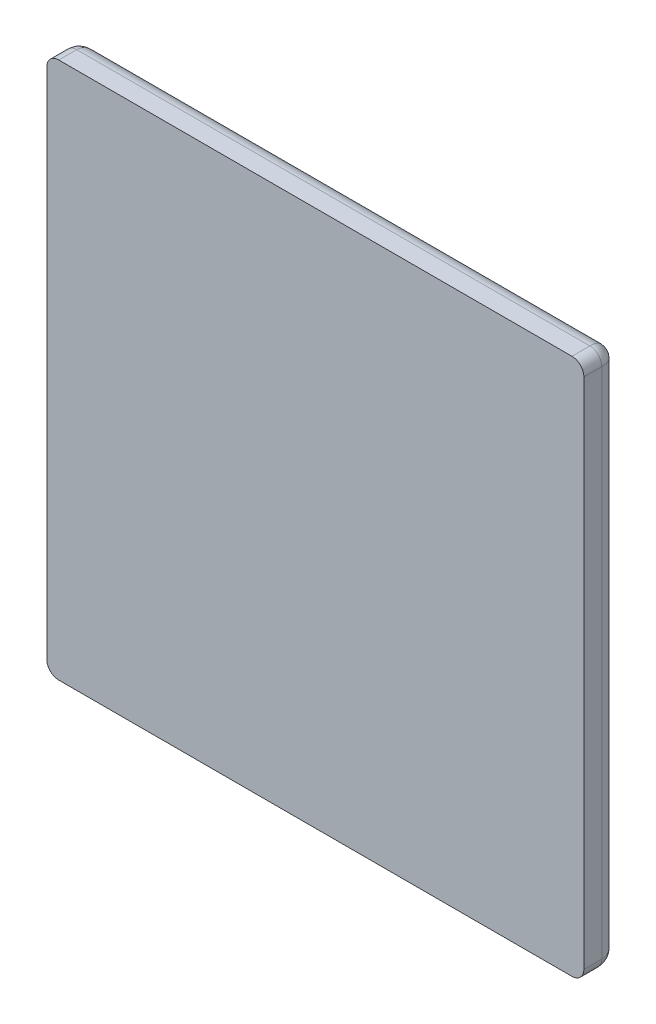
ISO-10303-21;
HEADER;
FILE_DESCRIPTION(('STEP AP214'),'2;1');
FILE_NAME('part.step','',(''),(''),'','','');
FILE_SCHEMA(('AUTOMOTIVE_DESIGN { 1 0 10303 214 1 1 1 1 }'));
ENDSEC;
DATA;
#1=APPLICATION_CONTEXT('core data for automotive mechanical design processes');
#2=APPLICATION_PROTOCOL_DEFINITION('international standard','automotive_design',2000,#1);
#3=PRODUCT_CONTEXT('',#1,'mechanical');
#4=PRODUCT('Part','Part','',(#3));
#5=PRODUCT_RELATED_PRODUCT_CATEGORY('part','',(#4));
#6=PRODUCT_DEFINITION_FORMATION('','',#4);
#7=PRODUCT_DEFINITION_CONTEXT('part definition',#1,'design');
#8=PRODUCT_DEFINITION('design','',#6,#7);
#9=PRODUCT_DEFINITION_SHAPE('','',#8);
#10=(LENGTH_UNIT() NAMED_UNIT(*) SI_UNIT(.MILLI.,.METRE.));
#11=(NAMED_UNIT(*) PLANE_ANGLE_UNIT() SI_UNIT($,.RADIAN.));
#12=(NAMED_UNIT(*) SI_UNIT($,.STERADIAN.) SOLID_ANGLE_UNIT());
#13=UNCERTAINTY_MEASURE_WITH_UNIT(LENGTH_MEASURE(1.E-05),#10,'distance_accuracy_value','');
#14=(GEOMETRIC_REPRESENTATION_CONTEXT(3) GLOBAL_UNCERTAINTY_ASSIGNED_CONTEXT((#13)) GLOBAL_UNIT_ASSIGNED_CONTEXT((#10,
#11,#12)) REPRESENTATION_CONTEXT('',''));
#15=CARTESIAN_POINT('',(0.,0.,0.));
#16=DIRECTION('',(0.,0.,1.));
#17=DIRECTION('',(1.,0.,0.));
#18=AXIS2_PLACEMENT_3D('',#15,#16,#17);
#19=CARTESIAN_POINT('',(21.5,-22.5,1.5));
#20=CARTESIAN_POINT('',(21.649599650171,-22.5,1.5));
#21=CARTESIAN_POINT('',(21.8738200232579,-22.4486419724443,1.5));
#22=CARTESIAN_POINT('',(22.1287012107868,-22.2883243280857,1.5));
#23=CARTESIAN_POINT('',(22.3150634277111,-22.1021506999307,1.5));
#24=CARTESIAN_POINT('',(22.461876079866,-21.8365639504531,1.5));
#25=CARTESIAN_POINT('',(22.5,-21.6121997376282,1.5));
#26=CARTESIAN_POINT('',(22.5,-21.5,1.5));
#27=CARTESIAN_POINT('',(21.5,-22.5,1.38780026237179));
#28=CARTESIAN_POINT('',(21.649599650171,-22.5,1.3765841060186));
#29=CARTESIAN_POINT('',(21.8738200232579,-22.4486419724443,1.36367785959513));
#30=CARTESIAN_POINT('',(22.1287012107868,-22.2883243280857,1.35659921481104));
#31=CARTESIAN_POINT('',(22.3150634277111,-22.1021506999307,1.3565890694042));
#32=CARTESIAN_POINT('',(22.461876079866,-21.8365639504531,1.36547389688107));
#33=CARTESIAN_POINT('',(22.5,-21.6121997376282,1.37940644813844));
#34=CARTESIAN_POINT('',(22.5,-21.5,1.38780026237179));
#35=CARTESIAN_POINT('',(21.4936678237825,-22.4810034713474,1.21952263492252));
#36=CARTESIAN_POINT('',(21.6388114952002,-22.4769995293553,1.19182072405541));
#37=CARTESIAN_POINT('',(21.8563548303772,-22.4220136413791,1.15996565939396));
#38=CARTESIAN_POINT('',(22.105124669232,-22.2621117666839,1.14250951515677));
#39=CARTESIAN_POINT('',(22.2883930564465,-22.0790090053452,1.14248346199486));
#40=CARTESIAN_POINT('',(22.4356076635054,-21.8202009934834,1.16439442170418));
#41=CARTESIAN_POINT('',(22.4779798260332,-21.602520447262,1.19878388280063));
#42=CARTESIAN_POINT('',(22.4810034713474,-21.4936678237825,1.21952263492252));
#43=CARTESIAN_POINT('',(21.4625698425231,-22.3877095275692,0.895590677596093));
#44=CARTESIAN_POINT('',(21.5887446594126,-22.3682176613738,0.846187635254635));
#45=CARTESIAN_POINT('',(21.7779362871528,-22.3005035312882,0.789958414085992));
#46=CARTESIAN_POINT('',(21.9999301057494,-22.1445543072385,0.759263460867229));
#47=CARTESIAN_POINT('',(22.1687470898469,-21.9758542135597,0.759224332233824));
#48=CARTESIAN_POINT('',(22.3152450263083,-21.7464641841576,0.797730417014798));
#49=CARTESIAN_POINT('',(22.3731290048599,-21.5572131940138,0.858598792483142));
#50=CARTESIAN_POINT('',(22.3877095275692,-21.4625698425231,0.895590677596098));
#51=CARTESIAN_POINT('',(21.3892696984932,-22.1678090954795,0.496985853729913));
#52=CARTESIAN_POINT('',(21.4789238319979,-22.1235341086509,0.445954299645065));
#53=CARTESIAN_POINT('',(21.6134381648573,-22.0389518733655,0.389505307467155));
#54=CARTESIAN_POINT('',(21.7810497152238,-21.8980557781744,0.359035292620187));
#55=CARTESIAN_POINT('',(21.9175921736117,-21.7615503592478,0.359013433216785));
#56=CARTESIAN_POINT('',(22.0546440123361,-21.5910240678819,0.397176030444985));
#57=CARTESIAN_POINT('',(22.1346789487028,-21.4565319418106,0.458741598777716));
#58=CARTESIAN_POINT('',(22.1678090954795,-21.3892696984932,0.496985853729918));
#59=CARTESIAN_POINT('',(21.2243681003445,-21.6731043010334,0.102454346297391));
#60=CARTESIAN_POINT('',(21.2669615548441,-21.6301718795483,0.088463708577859));
#61=CARTESIAN_POINT('',(21.3308859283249,-21.5659469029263,0.073741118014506));
#62=CARTESIAN_POINT('',(21.4162409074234,-21.4803297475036,0.065954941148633));
#63=CARTESIAN_POINT('',(21.4910280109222,-21.405556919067,0.065957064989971));
#64=CARTESIAN_POINT('',(21.5766653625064,-21.320228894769,0.075679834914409));
#65=CARTESIAN_POINT('',(21.6409664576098,-21.2563289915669,0.091950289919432));
#66=CARTESIAN_POINT('',(21.6731043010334,-21.2243681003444,0.102454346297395));
#67=CARTESIAN_POINT('',(21.0747998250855,-21.2243994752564,0.));
#68=CARTESIAN_POINT('',(21.089047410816,-21.2101518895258,0.));
#69=CARTESIAN_POINT('',(21.1104187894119,-21.18878051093,0.));
#70=CARTESIAN_POINT('',(21.138913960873,-21.1602853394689,0.));
#71=CARTESIAN_POINT('',(21.1638472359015,-21.1353520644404,0.));
#72=CARTESIAN_POINT('',(21.1923424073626,-21.1068568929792,0.));
#73=CARTESIAN_POINT('',(21.2137137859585,-21.0854855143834,0.));
#74=CARTESIAN_POINT('',(21.2243994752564,-21.0747998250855,0.));
#75=CARTESIAN_POINT('',(21.,-21.,0.));
#76=CARTESIAN_POINT('',(21.,-21.,0.));
#77=CARTESIAN_POINT('',(21.,-21.,0.));
#78=CARTESIAN_POINT('',(21.,-21.,0.));
#79=CARTESIAN_POINT('',(21.,-21.,0.));
#80=CARTESIAN_POINT('',(21.,-21.,0.));
#81=CARTESIAN_POINT('',(21.,-21.,0.));
#82=CARTESIAN_POINT('',(21.,-21.,0.));
#83=B_SPLINE_SURFACE_WITH_KNOTS('',3,3,((#19,#20,#21,#22,#23,#24,#25,#26),(#27,#28,#29,#30,#31,
#32,#33,#34),(#35,#36,#37,#38,#39,#40,#41,#42),(#43,#44,#45,#46,#47,#48,#49,#50),(#51,#52,#53,
#54,#55,#56,#57,#58),(#59,#60,#61,#62,#63,#64,#65,#66),(#67,#68,#69,#70,#71,#72,#73,#74),(#75,
#76,#77,#78,#79,#80,#81,#82)),.UNSPECIFIED.,.F.,.F.,.F.,(4,1,1,1,1,4),(4,1,1,1,1,4),(0.,
0.224399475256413,0.33659921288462,0.673198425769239,1.12199737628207,1.57079632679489),(0.,
0.285714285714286,0.428571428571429,0.571428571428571,0.785714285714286,1.),.UNSPECIFIED.);
#84=CARTESIAN_POINT('',(21.,-21.,0.));
#85=CARTESIAN_POINT('',(21.2243994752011,-21.0747998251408,0.));
#86=CARTESIAN_POINT('',(21.6731043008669,-21.22436810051,0.102454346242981));
#87=CARTESIAN_POINT('',(22.1678090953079,-21.3892696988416,0.496985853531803));
#88=CARTESIAN_POINT('',(22.3877095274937,-21.4625698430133,0.895590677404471));
#89=CARTESIAN_POINT('',(22.4810034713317,-21.4936678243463,1.21952263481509));
#90=CARTESIAN_POINT('',(22.5,-21.5000000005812,1.38780026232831));
#91=CARTESIAN_POINT('',(22.5,-21.5000000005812,1.5));
#92=B_SPLINE_CURVE_WITH_KNOTS('',3,(#84,#85,#86,#87,#88,#89,#90,#91),.UNSPECIFIED.,.F.,.F.,(4,1,
1,1,1,4),(0.,0.448798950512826,0.897597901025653,1.23419711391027,1.34639685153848,
1.57079632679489),.UNSPECIFIED.);
#93=CARTESIAN_POINT('',(22.5,-21.5000000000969,1.5));
#94=VERTEX_POINT('',#93);
#95=CARTESIAN_POINT('',(21.,-21.,0.));
#96=VERTEX_POINT('',#95);
#97=EDGE_CURVE('E113',#94,#96,#92,.F.);
#98=CARTESIAN_POINT('',(22.5,-21.5,1.5));
#99=CARTESIAN_POINT('',(22.5000000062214,-21.5130898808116,1.5));
#100=CARTESIAN_POINT('',(22.4997405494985,-21.5261796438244,1.5));
#101=CARTESIAN_POINT('',(22.4987061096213,-21.5523387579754,1.5));
#102=CARTESIAN_POINT('',(22.4979311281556,-21.5654081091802,1.5));
#103=CARTESIAN_POINT('',(22.4958690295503,-21.5915064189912,1.5));
#104=CARTESIAN_POINT('',(22.4945819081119,-21.6045353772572,1.5));
#105=CARTESIAN_POINT('',(22.4914989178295,-21.6305330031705,1.5));
#106=CARTESIAN_POINT('',(22.4897030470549,-21.6435016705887,1.5));
#107=CARTESIAN_POINT('',(22.4856059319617,-21.669358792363,1.5));
#108=CARTESIAN_POINT('',(22.4833046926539,-21.6822472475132,1.5));
#109=CARTESIAN_POINT('',(22.4782002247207,-21.7079240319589,1.5));
#110=CARTESIAN_POINT('',(22.4753970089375,-21.7207123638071,1.5));
#111=CARTESIAN_POINT('',(22.4692919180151,-21.746168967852,1.5));
#112=CARTESIAN_POINT('',(22.4659900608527,-21.7588372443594,1.5));
#113=CARTESIAN_POINT('',(22.4588912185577,-21.7840338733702,1.5));
#114=CARTESIAN_POINT('',(22.4550942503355,-21.7965622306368,1.5));
#115=CARTESIAN_POINT('',(22.447007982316,-21.8214588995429,1.5));
#116=CARTESIAN_POINT('',(22.442718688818,-21.8338272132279,1.5));
#117=CARTESIAN_POINT('',(22.4336539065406,-21.8583846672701,1.5));
#118=CARTESIAN_POINT('',(22.4288784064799,-21.8705738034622,1.5));
#119=CARTESIAN_POINT('',(22.418851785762,-21.8947554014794,1.5));
#120=CARTESIAN_POINT('',(22.4136006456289,-21.9067478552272,1.5));
#121=CARTESIAN_POINT('',(22.402632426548,-21.9305182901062,1.5));
#122=CARTESIAN_POINT('',(22.396915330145,-21.9422962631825,1.5));
#123=CARTESIAN_POINT('',(22.3850251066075,-21.9656200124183,1.5));
#124=CARTESIAN_POINT('',(22.3788519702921,-21.9771657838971,1.5));
#125=CARTESIAN_POINT('',(22.3660595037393,-22.0000073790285,1.5));
#126=CARTESIAN_POINT('',(22.3594401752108,-22.0113032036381,1.5));
#127=CARTESIAN_POINT('',(22.3457651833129,-22.0336271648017,1.5));
#128=CARTESIAN_POINT('',(22.3387095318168,-22.0446553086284,1.5));
#129=CARTESIAN_POINT('',(22.3241717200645,-22.066426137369,1.5));
#130=CARTESIAN_POINT('',(22.3166895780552,-22.0771688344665,1.5));
#131=CARTESIAN_POINT('',(22.3013087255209,-22.0983511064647,1.5));
#132=CARTESIAN_POINT('',(22.2934100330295,-22.1087906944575,1.5));
#133=CARTESIAN_POINT('',(22.2772056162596,-22.1293486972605,1.5));
#134=CARTESIAN_POINT('',(22.2688999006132,-22.1394671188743,1.5));
#135=CARTESIAN_POINT('',(22.2518957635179,-22.1593686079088,1.5));
#136=CARTESIAN_POINT('',(22.243197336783,-22.1691516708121,1.5));
#137=CARTESIAN_POINT('',(22.2254227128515,-22.1883689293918,1.5));
#138=CARTESIAN_POINT('',(22.2163465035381,-22.1978031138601,1.5));
#139=CARTESIAN_POINT('',(22.1978310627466,-22.2163089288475,1.5));
#140=CARTESIAN_POINT('',(22.1883918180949,-22.2253805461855,1.5));
#141=CARTESIAN_POINT('',(22.1691651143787,-22.2431475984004,1.5));
#142=CARTESIAN_POINT('',(22.1593776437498,-22.2518430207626,1.5));
#143=CARTESIAN_POINT('',(22.1394692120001,-22.2688439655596,1.5));
#144=CARTESIAN_POINT('',(22.1293482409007,-22.2771494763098,1.5));
#145=CARTESIAN_POINT('',(22.108787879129,-22.2933571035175,1.5));
#146=CARTESIAN_POINT('',(22.0983484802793,-22.3012592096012,1.5));
#147=CARTESIAN_POINT('',(22.0771681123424,-22.3166484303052,1.5));
#148=CARTESIAN_POINT('',(22.066427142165,-22.3241355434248,1.5));
#149=CARTESIAN_POINT('',(22.0446603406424,-22.3386829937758,1.5));
#150=CARTESIAN_POINT('',(22.0336345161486,-22.3457433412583,1.5));
#151=CARTESIAN_POINT('',(22.0113147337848,-22.3594254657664,1.5));
#152=CARTESIAN_POINT('',(22.0000207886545,-22.3660472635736,1.5));
#153=CARTESIAN_POINT('',(21.9771815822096,-22.3788406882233,1.5));
#154=CARTESIAN_POINT('',(21.965636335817,-22.385012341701,1.5));
#155=CARTESIAN_POINT('',(21.9423109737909,-22.3968931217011,1.5));
#156=CARTESIAN_POINT('',(21.9305308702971,-22.4026022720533,1.5));
#157=CARTESIAN_POINT('',(21.9067538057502,-22.4135491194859,1.5));
#158=CARTESIAN_POINT('',(21.8947568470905,-22.4187868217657,1.5));
#159=CARTESIAN_POINT('',(21.8705659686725,-22.4287866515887,1.5));
#160=CARTESIAN_POINT('',(21.8583720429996,-22.4335487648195,1.5));
#161=CARTESIAN_POINT('',(21.8338066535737,-22.4425923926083,1.5));
#162=CARTESIAN_POINT('',(21.8214351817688,-22.4468738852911,1.5));
#163=CARTESIAN_POINT('',(21.7965342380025,-22.4549514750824,1.5));
#164=CARTESIAN_POINT('',(21.7840047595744,-22.4587475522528,1.5));
#165=CARTESIAN_POINT('',(21.7588073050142,-22.4658494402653,1.5));
#166=CARTESIAN_POINT('',(21.7461393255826,-22.4691552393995,1.5));
#167=CARTESIAN_POINT('',(21.720684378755,-22.475271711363,1.5));
#168=CARTESIAN_POINT('',(21.707897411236,-22.4780823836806,1.5));
#169=CARTESIAN_POINT('',(21.6822239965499,-22.4832037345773,1.5));
#170=CARTESIAN_POINT('',(21.6693375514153,-22.4855144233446,1.5));
#171=CARTESIAN_POINT('',(21.6434846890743,-22.489630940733,1.5));
#172=CARTESIAN_POINT('',(21.6305182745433,-22.4914367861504,1.5));
#173=CARTESIAN_POINT('',(21.6045249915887,-22.4945387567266,1.5));
#174=CARTESIAN_POINT('',(21.5914981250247,-22.4958348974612,1.5));
#175=CARTESIAN_POINT('',(21.5654034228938,-22.4979125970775,1.5));
#176=CARTESIAN_POINT('',(21.5523355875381,-22.4986941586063,1.5));
#177=CARTESIAN_POINT('',(21.5261785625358,-22.4997378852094,1.5));
#178=CARTESIAN_POINT('',(21.5130893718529,-22.5000000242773,1.5));
#179=CARTESIAN_POINT('',(21.5,-22.5,1.5));
#180=B_SPLINE_CURVE_WITH_KNOTS('',3,(#98,#99,#100,#101,#102,#103,#104,#105,#106,#107,#108,#109,
#110,#111,#112,#113,#114,#115,#116,#117,#118,#119,#120,#121,#122,#123,#124,#125,#126,#127,#128,
#129,#130,#131,#132,#133,#134,#135,#136,#137,#138,#139,#140,#141,#142,#143,#144,#145,#146,#147,
#148,#149,#150,#151,#152,#153,#154,#155,#156,#157,#158,#159,#160,#161,#162,#163,#164,#165,#166,
#167,#168,#169,#170,#171,#172,#173,#174,#175,#176,#177,#178,#179),.UNSPECIFIED.,.F.,.F.,(4,2,2,
2,2,2,2,2,2,2,2,2,2,2,2,2,2,2,2,2,2,2,2,2,2,2,2,2,2,2,2,2,2,2,2,2,2,2,2,2,4),(0.,
0.0392669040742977,0.078533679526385,0.117800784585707,0.157068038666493,0.196334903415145,
0.235600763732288,0.274865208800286,0.314128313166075,0.353390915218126,0.392654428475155,
0.431919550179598,0.471186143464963,0.510453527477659,0.549720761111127,0.58898692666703,
0.628251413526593,0.667514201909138,0.706776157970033,0.746038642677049,0.785302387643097,
0.824567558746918,0.863834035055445,0.903101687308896,0.942370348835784,0.981639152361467,
1.02090701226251,1.06017301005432,1.09943668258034,1.13869833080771,1.17795954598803,
1.21722194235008,1.2564861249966,1.29575191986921,1.33501865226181,1.37428542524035,
1.41355139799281,1.45281606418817,1.49207953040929,1.53134279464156,1.57060802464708),.UNSPECIFIED.);
#181=CARTESIAN_POINT('',(21.5,-22.5,1.5));
#182=VERTEX_POINT('',#181);
#183=EDGE_CURVE('E96',#94,#182,#180,.T.);
#184=CARTESIAN_POINT('',(21.5,-22.5,1.5));
#185=CARTESIAN_POINT('',(21.5,-22.5,1.38780026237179));
#186=CARTESIAN_POINT('',(21.4936678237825,-22.4810034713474,1.21952263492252));
#187=CARTESIAN_POINT('',(21.4625698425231,-22.3877095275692,0.895590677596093));
#188=CARTESIAN_POINT('',(21.3892696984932,-22.1678090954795,0.496985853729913));
#189=CARTESIAN_POINT('',(21.2243681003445,-21.6731043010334,0.102454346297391));
#190=CARTESIAN_POINT('',(21.0747998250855,-21.2243994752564,0.));
#191=CARTESIAN_POINT('',(21.,-21.,0.));
#192=B_SPLINE_CURVE_WITH_KNOTS('',3,(#184,#185,#186,#187,#188,#189,#190,#191),.UNSPECIFIED.,.F.,
.F.,(4,1,1,1,1,4),(0.,0.224399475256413,0.33659921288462,0.673198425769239,1.12199737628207,
1.57079632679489),.UNSPECIFIED.);
#193=EDGE_CURVE('E117',#96,#182,#192,.F.);
#194=ORIENTED_EDGE('',*,*,#97,.F.);
#195=ORIENTED_EDGE('',*,*,#183,.T.);
#196=ORIENTED_EDGE('',*,*,#193,.F.);
#197=EDGE_LOOP('',(#194,#195,#196));
#198=FACE_BOUND('',#197,.T.);
#199=ADVANCED_FACE('F16',(#198),#83,.T.);
#200=CARTESIAN_POINT('',(22.5,21.5,1.5));
#201=CARTESIAN_POINT('',(22.5,21.6495996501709,1.5));
#202=CARTESIAN_POINT('',(22.4486419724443,21.8738200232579,1.5));
#203=CARTESIAN_POINT('',(22.2883243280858,22.1287012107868,1.5));
#204=CARTESIAN_POINT('',(22.1021506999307,22.3150634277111,1.5));
#205=CARTESIAN_POINT('',(21.8365639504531,22.461876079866,1.5));
#206=CARTESIAN_POINT('',(21.6121997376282,22.5,1.5));
#207=CARTESIAN_POINT('',(21.5,22.5,1.5));
#208=CARTESIAN_POINT('',(22.5,21.5,1.3878002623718));
#209=CARTESIAN_POINT('',(22.5,21.6495996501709,1.3765841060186));
#210=CARTESIAN_POINT('',(22.4486419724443,21.8738200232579,1.36367785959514));
#211=CARTESIAN_POINT('',(22.2883243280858,22.1287012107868,1.35659921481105));
#212=CARTESIAN_POINT('',(22.1021506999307,22.3150634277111,1.3565890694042));
#213=CARTESIAN_POINT('',(21.8365639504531,22.461876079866,1.36547389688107));
#214=CARTESIAN_POINT('',(21.6121997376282,22.5,1.37940644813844));
#215=CARTESIAN_POINT('',(21.5,22.5,1.38780026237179));
#216=CARTESIAN_POINT('',(22.4810034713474,21.4936678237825,1.21952263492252));
#217=CARTESIAN_POINT('',(22.4769995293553,21.6388114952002,1.19182072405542));
#218=CARTESIAN_POINT('',(22.4220136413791,21.8563548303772,1.15996565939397));
#219=CARTESIAN_POINT('',(22.2621117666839,22.105124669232,1.14250951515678));
#220=CARTESIAN_POINT('',(22.0790090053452,22.2883930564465,1.14248346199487));
#221=CARTESIAN_POINT('',(21.8202009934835,22.4356076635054,1.16439442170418));
#222=CARTESIAN_POINT('',(21.602520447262,22.4779798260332,1.19878388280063));
#223=CARTESIAN_POINT('',(21.4936678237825,22.4810034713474,1.21952263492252));
#224=CARTESIAN_POINT('',(22.3877095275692,21.4625698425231,0.895590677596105));
#225=CARTESIAN_POINT('',(22.3682176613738,21.5887446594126,0.846187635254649));
#226=CARTESIAN_POINT('',(22.3005035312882,21.7779362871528,0.789958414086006));
#227=CARTESIAN_POINT('',(22.1445543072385,21.9999301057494,0.759263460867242));
#228=CARTESIAN_POINT('',(21.9758542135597,22.1687470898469,0.759224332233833));
#229=CARTESIAN_POINT('',(21.7464641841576,22.3152450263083,0.797730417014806));
#230=CARTESIAN_POINT('',(21.5572131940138,22.3731290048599,0.858598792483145));
#231=CARTESIAN_POINT('',(21.4625698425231,22.3877095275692,0.8955906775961));
#232=CARTESIAN_POINT('',(22.1678090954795,21.3892696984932,0.496985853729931));
#233=CARTESIAN_POINT('',(22.1235341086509,21.4789238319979,0.445954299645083));
#234=CARTESIAN_POINT('',(22.0389518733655,21.6134381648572,0.389505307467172));
#235=CARTESIAN_POINT('',(21.8980557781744,21.7810497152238,0.359035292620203));
#236=CARTESIAN_POINT('',(21.7615503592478,21.9175921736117,0.359013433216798));
#237=CARTESIAN_POINT('',(21.5910240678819,22.0546440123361,0.397176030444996));
#238=CARTESIAN_POINT('',(21.4565319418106,22.1346789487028,0.458741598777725));
#239=CARTESIAN_POINT('',(21.3892696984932,22.1678090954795,0.496985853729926));
#240=CARTESIAN_POINT('',(21.6731043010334,21.2243681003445,0.102454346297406));
#241=CARTESIAN_POINT('',(21.6301718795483,21.2669615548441,0.088463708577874));
#242=CARTESIAN_POINT('',(21.5659469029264,21.3308859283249,0.073741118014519));
#243=CARTESIAN_POINT('',(21.4803297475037,21.4162409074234,0.065954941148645));
#244=CARTESIAN_POINT('',(21.405556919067,21.4910280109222,0.06595706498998));
#245=CARTESIAN_POINT('',(21.320228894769,21.5766653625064,0.075679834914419));
#246=CARTESIAN_POINT('',(21.2563289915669,21.6409664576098,0.09195028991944));
#247=CARTESIAN_POINT('',(21.2243681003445,21.6731043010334,0.102454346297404));
#248=CARTESIAN_POINT('',(21.2243994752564,21.0747998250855,0.));
#249=CARTESIAN_POINT('',(21.2101518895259,21.089047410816,0.));
#250=CARTESIAN_POINT('',(21.18878051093,21.1104187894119,0.));
#251=CARTESIAN_POINT('',(21.1602853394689,21.138913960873,0.));
#252=CARTESIAN_POINT('',(21.1353520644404,21.1638472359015,0.));
#253=CARTESIAN_POINT('',(21.1068568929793,21.1923424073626,0.));
#254=CARTESIAN_POINT('',(21.0854855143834,21.2137137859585,0.));
#255=CARTESIAN_POINT('',(21.0747998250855,21.2243994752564,0.));
#256=CARTESIAN_POINT('',(21.,21.,0.));
#257=CARTESIAN_POINT('',(21.,21.,0.));
#258=CARTESIAN_POINT('',(21.,21.,0.));
#259=CARTESIAN_POINT('',(21.,21.,0.));
#260=CARTESIAN_POINT('',(21.,21.,0.));
#261=CARTESIAN_POINT('',(21.,21.,0.));
#262=CARTESIAN_POINT('',(21.,21.,0.));
#263=CARTESIAN_POINT('',(21.,21.,0.));
#264=B_SPLINE_SURFACE_WITH_KNOTS('',3,3,((#200,#201,#202,#203,#204,#205,#206,#207),(#208,#209,
#210,#211,#212,#213,#214,#215),(#216,#217,#218,#219,#220,#221,#222,#223),(#224,#225,#226,#227,
#228,#229,#230,#231),(#232,#233,#234,#235,#236,#237,#238,#239),(#240,#241,#242,#243,#244,#245,
#246,#247),(#248,#249,#250,#251,#252,#253,#254,#255),(#256,#257,#258,#259,#260,#261,#262,#263)),
.UNSPECIFIED.,.F.,.F.,.F.,(4,1,1,1,1,4),(4,1,1,1,1,4),(0.,0.224399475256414,0.336599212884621,
0.673198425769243,1.12199737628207,1.5707963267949),(0.,0.285714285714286,0.428571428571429,
0.571428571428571,0.785714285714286,1.),.UNSPECIFIED.);
#265=CARTESIAN_POINT('',(21.,21.,0.));
#266=CARTESIAN_POINT('',(21.074799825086,21.2243994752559,0.));
#267=CARTESIAN_POINT('',(21.2243681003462,21.6731043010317,0.102454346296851));
#268=CARTESIAN_POINT('',(21.3892696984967,22.1678090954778,0.496985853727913));
#269=CARTESIAN_POINT('',(21.462569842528,22.3877095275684,0.895590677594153));
#270=CARTESIAN_POINT('',(21.4936678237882,22.4810034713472,1.21952263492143));
#271=CARTESIAN_POINT('',(21.5000000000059,22.5,1.38780026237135));
#272=CARTESIAN_POINT('',(21.5000000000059,22.5,1.5));
#273=B_SPLINE_CURVE_WITH_KNOTS('',3,(#265,#266,#267,#268,#269,#270,#271,#272),.UNSPECIFIED.,.F.,
.F.,(4,1,1,1,1,4),(0.,0.448798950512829,0.897597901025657,1.23419711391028,1.34639685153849,
1.5707963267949),.UNSPECIFIED.);
#274=CARTESIAN_POINT('',(21.5,22.5,1.5));
#275=VERTEX_POINT('',#274);
#276=CARTESIAN_POINT('',(21.,21.,0.));
#277=VERTEX_POINT('',#276);
#278=EDGE_CURVE('E232',#275,#277,#273,.F.);
#279=CARTESIAN_POINT('',(21.5,22.5,1.5));
#280=CARTESIAN_POINT('',(21.5130898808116,22.5000000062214,1.5));
#281=CARTESIAN_POINT('',(21.5261796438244,22.4997405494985,1.5));
#282=CARTESIAN_POINT('',(21.5523387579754,22.4987061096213,1.5));
#283=CARTESIAN_POINT('',(21.5654081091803,22.4979311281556,1.5));
#284=CARTESIAN_POINT('',(21.5915064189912,22.4958690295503,1.5));
#285=CARTESIAN_POINT('',(21.6045353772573,22.4945819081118,1.5));
#286=CARTESIAN_POINT('',(21.6305330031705,22.4914989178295,1.5));
#287=CARTESIAN_POINT('',(21.6435016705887,22.4897030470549,1.5));
#288=CARTESIAN_POINT('',(21.669358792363,22.4856059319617,1.5));
#289=CARTESIAN_POINT('',(21.6822472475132,22.4833046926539,1.5));
#290=CARTESIAN_POINT('',(21.7079240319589,22.4782002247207,1.5));
#291=CARTESIAN_POINT('',(21.7207123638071,22.4753970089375,1.5));
#292=CARTESIAN_POINT('',(21.746168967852,22.4692919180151,1.5));
#293=CARTESIAN_POINT('',(21.7588372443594,22.4659900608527,1.5));
#294=CARTESIAN_POINT('',(21.7840338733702,22.4588912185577,1.5));
#295=CARTESIAN_POINT('',(21.7965622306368,22.4550942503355,1.5));
#296=CARTESIAN_POINT('',(21.8214588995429,22.447007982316,1.5));
#297=CARTESIAN_POINT('',(21.8338272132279,22.442718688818,1.5));
#298=CARTESIAN_POINT('',(21.8583846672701,22.4336539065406,1.5));
#299=CARTESIAN_POINT('',(21.8705738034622,22.4288784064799,1.5));
#300=CARTESIAN_POINT('',(21.8947554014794,22.418851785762,1.5));
#301=CARTESIAN_POINT('',(21.9067478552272,22.4136006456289,1.5));
#302=CARTESIAN_POINT('',(21.9305182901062,22.402632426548,1.5));
#303=CARTESIAN_POINT('',(21.9422962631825,22.396915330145,1.5));
#304=CARTESIAN_POINT('',(21.9656200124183,22.3850251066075,1.5));
#305=CARTESIAN_POINT('',(21.9771657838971,22.3788519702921,1.5));
#306=CARTESIAN_POINT('',(22.0000073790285,22.3660595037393,1.5));
#307=CARTESIAN_POINT('',(22.0113032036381,22.3594401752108,1.5));
#308=CARTESIAN_POINT('',(22.0336271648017,22.3457651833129,1.5));
#309=CARTESIAN_POINT('',(22.0446553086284,22.3387095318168,1.5));
#310=CARTESIAN_POINT('',(22.066426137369,22.3241717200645,1.5));
#311=CARTESIAN_POINT('',(22.0771688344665,22.3166895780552,1.5));
#312=CARTESIAN_POINT('',(22.0983511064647,22.3013087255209,1.5));
#313=CARTESIAN_POINT('',(22.1087906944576,22.2934100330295,1.5));
#314=CARTESIAN_POINT('',(22.1293486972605,22.2772056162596,1.5));
#315=CARTESIAN_POINT('',(22.1394671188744,22.2688999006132,1.5));
#316=CARTESIAN_POINT('',(22.1593686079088,22.2518957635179,1.5));
#317=CARTESIAN_POINT('',(22.1691516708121,22.243197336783,1.5));
#318=CARTESIAN_POINT('',(22.1883689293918,22.2254227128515,1.5));
#319=CARTESIAN_POINT('',(22.1978031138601,22.2163465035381,1.5));
#320=CARTESIAN_POINT('',(22.2163089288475,22.1978310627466,1.5));
#321=CARTESIAN_POINT('',(22.2253805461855,22.1883918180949,1.5));
#322=CARTESIAN_POINT('',(22.2431475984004,22.1691651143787,1.5));
#323=CARTESIAN_POINT('',(22.2518430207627,22.1593776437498,1.5));
#324=CARTESIAN_POINT('',(22.2688439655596,22.1394692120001,1.5));
#325=CARTESIAN_POINT('',(22.2771494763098,22.1293482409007,1.5));
#326=CARTESIAN_POINT('',(22.2933571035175,22.108787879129,1.5));
#327=CARTESIAN_POINT('',(22.3012592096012,22.0983484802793,1.5));
#328=CARTESIAN_POINT('',(22.3166484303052,22.0771681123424,1.5));
#329=CARTESIAN_POINT('',(22.3241355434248,22.066427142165,1.5));
#330=CARTESIAN_POINT('',(22.3386829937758,22.0446603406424,1.5));
#331=CARTESIAN_POINT('',(22.3457433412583,22.0336345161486,1.5));
#332=CARTESIAN_POINT('',(22.3594254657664,22.0113147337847,1.5));
#333=CARTESIAN_POINT('',(22.3660472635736,22.0000207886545,1.5));
#334=CARTESIAN_POINT('',(22.3788406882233,21.9771815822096,1.5));
#335=CARTESIAN_POINT('',(22.385012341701,21.965636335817,1.5));
#336=CARTESIAN_POINT('',(22.3968931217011,21.9423109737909,1.5));
#337=CARTESIAN_POINT('',(22.4026022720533,21.9305308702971,1.5));
#338=CARTESIAN_POINT('',(22.4135491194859,21.9067538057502,1.5));
#339=CARTESIAN_POINT('',(22.4187868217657,21.8947568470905,1.5));
#340=CARTESIAN_POINT('',(22.4287866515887,21.8705659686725,1.5));
#341=CARTESIAN_POINT('',(22.4335487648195,21.8583720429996,1.5));
#342=CARTESIAN_POINT('',(22.4425923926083,21.8338066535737,1.5));
#343=CARTESIAN_POINT('',(22.4468738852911,21.8214351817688,1.5));
#344=CARTESIAN_POINT('',(22.4549514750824,21.7965342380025,1.5));
#345=CARTESIAN_POINT('',(22.4587475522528,21.7840047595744,1.5));
#346=CARTESIAN_POINT('',(22.4658494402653,21.7588073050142,1.5));
#347=CARTESIAN_POINT('',(22.4691552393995,21.7461393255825,1.5));
#348=CARTESIAN_POINT('',(22.475271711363,21.7206843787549,1.5));
#349=CARTESIAN_POINT('',(22.4780823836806,21.707897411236,1.5));
#350=CARTESIAN_POINT('',(22.4832037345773,21.6822239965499,1.5));
#351=CARTESIAN_POINT('',(22.4855144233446,21.6693375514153,1.5));
#352=CARTESIAN_POINT('',(22.489630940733,21.6434846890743,1.5));
#353=CARTESIAN_POINT('',(22.4914367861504,21.6305182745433,1.5));
#354=CARTESIAN_POINT('',(22.4945387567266,21.6045249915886,1.5));
#355=CARTESIAN_POINT('',(22.4958348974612,21.5914981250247,1.5));
#356=CARTESIAN_POINT('',(22.4979125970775,21.5654034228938,1.5));
#357=CARTESIAN_POINT('',(22.4986941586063,21.552335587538,1.5));
#358=CARTESIAN_POINT('',(22.4997378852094,21.5261785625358,1.5));
#359=CARTESIAN_POINT('',(22.5000000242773,21.5130893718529,1.5));
#360=CARTESIAN_POINT('',(22.5,21.5,1.5));
#361=B_SPLINE_CURVE_WITH_KNOTS('',3,(#279,#280,#281,#282,#283,#284,#285,#286,#287,#288,#289,
#290,#291,#292,#293,#294,#295,#296,#297,#298,#299,#300,#301,#302,#303,#304,#305,#306,#307,#308,
#309,#310,#311,#312,#313,#314,#315,#316,#317,#318,#319,#320,#321,#322,#323,#324,#325,#326,#327,
#328,#329,#330,#331,#332,#333,#334,#335,#336,#337,#338,#339,#340,#341,#342,#343,#344,#345,#346,
#347,#348,#349,#350,#351,#352,#353,#354,#355,#356,#357,#358,#359,#360),.UNSPECIFIED.,.F.,.F.,(4,
2,2,2,2,2,2,2,2,2,2,2,2,2,2,2,2,2,2,2,2,2,2,2,2,2,2,2,2,2,2,2,2,2,2,2,2,2,2,2,4),(0.,
0.0392669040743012,0.078533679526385,0.117800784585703,0.1570680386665,0.196334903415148,
0.235600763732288,0.274865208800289,0.314128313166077,0.353390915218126,0.392654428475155,
0.4319195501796,0.471186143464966,0.510453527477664,0.549720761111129,0.588986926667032,
0.628251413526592,0.667514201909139,0.706776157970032,0.746038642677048,0.785302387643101,
0.824567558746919,0.863834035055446,0.903101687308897,0.942370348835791,0.981639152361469,
1.02090701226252,1.06017301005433,1.09943668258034,1.13869833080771,1.17795954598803,
1.21722194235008,1.25648612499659,1.2957519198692,1.3350186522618,1.37428542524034,
1.4135513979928,1.45281606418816,1.49207953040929,1.53134279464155,1.57060802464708),.UNSPECIFIED.);
#362=CARTESIAN_POINT('',(22.5,21.5,1.5));
#363=VERTEX_POINT('',#362);
#364=EDGE_CURVE('E109',#275,#363,#361,.T.);
#365=CARTESIAN_POINT('',(22.5,21.5,1.5));
#366=CARTESIAN_POINT('',(22.500000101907,21.500000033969,1.48036473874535));
#367=CARTESIAN_POINT('',(22.499612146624,21.4998707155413,1.4607296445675));
#368=CARTESIAN_POINT('',(22.4980646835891,21.4993548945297,1.42149025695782));
#369=CARTESIAN_POINT('',(22.4969050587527,21.4989683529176,1.40188596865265));
#370=CARTESIAN_POINT('',(22.4938183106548,21.4979394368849,1.3627381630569));
#371=CARTESIAN_POINT('',(22.4918909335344,21.4972969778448,1.343194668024));
#372=CARTESIAN_POINT('',(22.487272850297,21.4957576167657,1.30419829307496));
#373=CARTESIAN_POINT('',(22.4845817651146,21.4948605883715,1.28474546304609));
#374=CARTESIAN_POINT('',(22.4784404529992,21.4928134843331,1.24596026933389));
#375=CARTESIAN_POINT('',(22.4749897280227,21.4916632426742,1.22662799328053));
#376=CARTESIAN_POINT('',(22.4673330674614,21.4891110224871,1.18811379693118));
#377=CARTESIAN_POINT('',(22.463126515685,21.4877088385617,1.16893201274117));
#378=CARTESIAN_POINT('',(22.4539632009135,21.4846544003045,1.13074852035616));
#379=CARTESIAN_POINT('',(22.4490057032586,21.4830019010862,1.11174700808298));
#380=CARTESIAN_POINT('',(22.4383486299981,21.4794495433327,1.0739529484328));
#381=CARTESIAN_POINT('',(22.4326482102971,21.4775494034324,1.05516066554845));
#382=CARTESIAN_POINT('',(22.420512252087,21.473504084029,1.01781432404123));
#383=CARTESIAN_POINT('',(22.4140757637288,21.4713585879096,0.999260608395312));
#384=CARTESIAN_POINT('',(22.4004780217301,21.4668260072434,0.962419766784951));
#385=CARTESIAN_POINT('',(22.3933157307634,21.4644385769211,0.94413306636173));
#386=CARTESIAN_POINT('',(22.3782810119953,21.4594270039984,0.907853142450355));
#387=CARTESIAN_POINT('',(22.3704074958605,21.4568024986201,0.889860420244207));
#388=CARTESIAN_POINT('',(22.3539640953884,21.4513213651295,0.854195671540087));
#389=CARTESIAN_POINT('',(22.345393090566,21.448464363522,0.83652421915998));
#390=CARTESIAN_POINT('',(22.3275686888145,21.4425228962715,0.801529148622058));
#391=CARTESIAN_POINT('',(22.3183141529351,21.4394380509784,0.784206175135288));
#392=CARTESIAN_POINT('',(22.2991365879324,21.4330455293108,0.749935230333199));
#393=CARTESIAN_POINT('',(22.2892124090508,21.4297374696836,0.732987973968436));
#394=CARTESIAN_POINT('',(22.2687094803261,21.4229031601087,0.699495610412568));
#395=CARTESIAN_POINT('',(22.2581295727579,21.4193765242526,0.682951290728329));
#396=CARTESIAN_POINT('',(22.2363290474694,21.4121096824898,0.650292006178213));
#397=CARTESIAN_POINT('',(22.2251072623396,21.4083690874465,0.634177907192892));
#398=CARTESIAN_POINT('',(22.2020370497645,21.4006790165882,0.602406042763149));
#399=CARTESIAN_POINT('',(22.1901874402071,21.3967291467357,0.586749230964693));
#400=CARTESIAN_POINT('',(22.1658749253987,21.3886249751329,0.555919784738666));
#401=CARTESIAN_POINT('',(22.1534108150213,21.3844702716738,0.540748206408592));
#402=CARTESIAN_POINT('',(22.1278920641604,21.3759640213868,0.510909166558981));
#403=CARTESIAN_POINT('',(22.11483622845,21.37161207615,0.496242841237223));
#404=CARTESIAN_POINT('',(22.0881580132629,21.3627193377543,0.467432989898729));
#405=CARTESIAN_POINT('',(22.0745344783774,21.3581781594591,0.453290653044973));
#406=CARTESIAN_POINT('',(22.0467444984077,21.3489148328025,0.425547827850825));
#407=CARTESIAN_POINT('',(22.0325769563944,21.3441923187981,0.411948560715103));
#408=CARTESIAN_POINT('',(22.003722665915,21.3345742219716,0.385310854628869));
#409=CARTESIAN_POINT('',(21.9890348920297,21.3296782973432,0.372273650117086));
#410=CARTESIAN_POINT('',(21.9591638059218,21.3197212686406,0.346779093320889));
#411=CARTESIAN_POINT('',(21.9439795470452,21.3146598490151,0.334322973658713));
#412=CARTESIAN_POINT('',(21.9131391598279,21.3043797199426,0.310009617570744));
#413=CARTESIAN_POINT('',(21.8974821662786,21.2991607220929,0.298153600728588));
#414=CARTESIAN_POINT('',(21.8657199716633,21.2885733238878,0.275059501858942));
#415=CARTESIAN_POINT('',(21.8496139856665,21.2832046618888,0.263822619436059));
#416=CARTESIAN_POINT('',(21.8169774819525,21.2723258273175,0.241985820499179));
#417=CARTESIAN_POINT('',(21.8004462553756,21.2668154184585,0.231387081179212));
#418=CARTESIAN_POINT('',(21.7669829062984,21.2556609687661,0.210845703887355));
#419=CARTESIAN_POINT('',(21.7500501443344,21.2500167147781,0.200904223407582));
#420=CARTESIAN_POINT('',(21.7158075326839,21.2386025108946,0.181696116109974));
#421=CARTESIAN_POINT('',(21.6984971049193,21.2328323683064,0.172430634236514));
#422=CARTESIAN_POINT('',(21.6635223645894,21.2211741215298,0.154594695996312));
#423=CARTESIAN_POINT('',(21.6458575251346,21.2152858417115,0.14602538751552));
#424=CARTESIAN_POINT('',(21.6102003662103,21.2034001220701,0.12959585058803));
#425=CARTESIAN_POINT('',(21.5922075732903,21.1974025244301,0.12173676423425));
#426=CARTESIAN_POINT('',(21.5559247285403,21.1853082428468,0.106733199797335));
#427=CARTESIAN_POINT('',(21.5376342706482,21.1792114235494,0.0995898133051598));
#428=CARTESIAN_POINT('',(21.5007855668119,21.1669285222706,0.0860248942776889));
#429=CARTESIAN_POINT('',(21.4822269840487,21.1607423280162,0.0796043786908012));
#430=CARTESIAN_POINT('',(21.4448717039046,21.1482905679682,0.0674920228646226));
#431=CARTESIAN_POINT('',(21.4260747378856,21.1420249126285,0.061801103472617));
#432=CARTESIAN_POINT('',(21.3882723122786,21.1294241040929,0.0511549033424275));
#433=CARTESIAN_POINT('',(21.3692666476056,21.1230888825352,0.04620043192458));
#434=CARTESIAN_POINT('',(21.3310764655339,21.1103588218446,0.037034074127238));
#435=CARTESIAN_POINT('',(21.3118917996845,21.1039639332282,0.0328228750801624));
#436=CARTESIAN_POINT('',(21.2733732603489,21.0911244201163,0.0251500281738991));
#437=CARTESIAN_POINT('',(21.2540392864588,21.0846797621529,0.0216889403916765));
#438=CARTESIAN_POINT('',(21.2152517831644,21.0717505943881,0.0155232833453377));
#439=CARTESIAN_POINT('',(21.1957981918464,21.0652660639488,0.0128191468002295));
#440=CARTESIAN_POINT('',(21.1568011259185,21.0522670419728,0.00817436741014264));
#441=CARTESIAN_POINT('',(21.1372576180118,21.0457525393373,0.00623403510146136));
#442=CARTESIAN_POINT('',(21.0981103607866,21.0327034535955,0.00312380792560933));
#443=CARTESIAN_POINT('',(21.0785065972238,21.0261688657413,0.00195411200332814));
#444=CARTESIAN_POINT('',(21.0392686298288,21.0130895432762,0.000392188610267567));
#445=CARTESIAN_POINT('',(21.0196344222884,21.0065448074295,6.47565137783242E-08));
#446=CARTESIAN_POINT('',(21.,21.,0.));
#447=B_SPLINE_CURVE_WITH_KNOTS('',3,(#365,#366,#367,#368,#369,#370,#371,#372,#373,#374,#375,
#376,#377,#378,#379,#380,#381,#382,#383,#384,#385,#386,#387,#388,#389,#390,#391,#392,#393,#394,
#395,#396,#397,#398,#399,#400,#401,#402,#403,#404,#405,#406,#407,#408,#409,#410,#411,#412,#413,
#414,#415,#416,#417,#418,#419,#420,#421,#422,#423,#424,#425,#426,#427,#428,#429,#430,#431,#432,
#433,#434,#435,#436,#437,#438,#439,#440,#441,#442,#443,#444,#445,#446),.UNSPECIFIED.,.F.,.F.,(4,
2,2,2,2,2,2,2,2,2,2,2,2,2,2,2,2,2,2,2,2,2,2,2,2,2,2,2,2,2,2,2,2,2,2,2,2,2,2,2,4),(0.,
0.0589012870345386,0.117811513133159,0.17674123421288,0.235700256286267,0.294698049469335,
0.353744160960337,0.412848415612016,0.472020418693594,0.531269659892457,0.590604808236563,
0.650032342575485,0.709557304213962,0.769183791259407,0.828915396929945,0.888755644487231,
0.94870841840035,1.00877839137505,1.06897125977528,1.12929166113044,1.18974147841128,
1.25032034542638,1.31102610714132,1.37185527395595,1.43280347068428,1.49386588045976,
1.55503768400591,1.61631449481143,1.67769279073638,1.73917031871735,1.80074501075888,
1.86241223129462,1.92416515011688,1.98599525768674,2.04789281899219,2.10984732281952,
2.17184792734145,2.23388390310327,2.29594507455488,2.35802226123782,2.42010771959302),.UNSPECIFIED.);
#448=EDGE_CURVE('E124',#277,#363,#447,.F.);
#449=ORIENTED_EDGE('',*,*,#278,.F.);
#450=ORIENTED_EDGE('',*,*,#364,.T.);
#451=ORIENTED_EDGE('',*,*,#448,.F.);
#452=EDGE_LOOP('',(#449,#450,#451));
#453=FACE_BOUND('',#452,.T.);
#454=ADVANCED_FACE('F332',(#453),#264,.T.);
#455=CARTESIAN_POINT('',(-21.5,22.5,1.5));
#456=CARTESIAN_POINT('',(-21.6495996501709,22.5,1.5));
#457=CARTESIAN_POINT('',(-21.8738200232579,22.4486419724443,1.5));
#458=CARTESIAN_POINT('',(-22.1287012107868,22.2883243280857,1.5));
#459=CARTESIAN_POINT('',(-22.3150634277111,22.1021506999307,1.5));
#460=CARTESIAN_POINT('',(-22.461876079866,21.8365639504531,1.5));
#461=CARTESIAN_POINT('',(-22.5,21.6121997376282,1.5));
#462=CARTESIAN_POINT('',(-22.5,21.5,1.5));
#463=CARTESIAN_POINT('',(-21.5,22.5,1.38780026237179));
#464=CARTESIAN_POINT('',(-21.6495996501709,22.5,1.3765841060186));
#465=CARTESIAN_POINT('',(-21.8738200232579,22.4486419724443,1.36367785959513));
#466=CARTESIAN_POINT('',(-22.1287012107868,22.2883243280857,1.35659921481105));
#467=CARTESIAN_POINT('',(-22.3150634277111,22.1021506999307,1.3565890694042));
#468=CARTESIAN_POINT('',(-22.461876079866,21.8365639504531,1.36547389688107));
#469=CARTESIAN_POINT('',(-22.5,21.6121997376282,1.37940644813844));
#470=CARTESIAN_POINT('',(-22.5,21.5,1.38780026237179));
#471=CARTESIAN_POINT('',(-21.4936678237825,22.4810034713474,1.21952263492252));
#472=CARTESIAN_POINT('',(-21.6388114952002,22.4769995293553,1.19182072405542));
#473=CARTESIAN_POINT('',(-21.8563548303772,22.4220136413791,1.15996565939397));
#474=CARTESIAN_POINT('',(-22.105124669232,22.2621117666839,1.14250951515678));
#475=CARTESIAN_POINT('',(-22.2883930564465,22.0790090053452,1.14248346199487));
#476=CARTESIAN_POINT('',(-22.4356076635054,21.8202009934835,1.16439442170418));
#477=CARTESIAN_POINT('',(-22.4779798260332,21.602520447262,1.19878388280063));
#478=CARTESIAN_POINT('',(-22.4810034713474,21.4936678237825,1.21952263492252));
#479=CARTESIAN_POINT('',(-21.4625698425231,22.3877095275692,0.895590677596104));
#480=CARTESIAN_POINT('',(-21.5887446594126,22.3682176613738,0.846187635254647));
#481=CARTESIAN_POINT('',(-21.7779362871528,22.3005035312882,0.789958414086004));
#482=CARTESIAN_POINT('',(-21.9999301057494,22.1445543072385,0.75926346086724));
#483=CARTESIAN_POINT('',(-22.1687470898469,21.9758542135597,0.759224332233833));
#484=CARTESIAN_POINT('',(-22.3152450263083,21.7464641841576,0.797730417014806));
#485=CARTESIAN_POINT('',(-22.3731290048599,21.5572131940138,0.858598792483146));
#486=CARTESIAN_POINT('',(-22.3877095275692,21.4625698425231,0.895590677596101));
#487=CARTESIAN_POINT('',(-21.3892696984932,22.1678090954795,0.496985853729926));
#488=CARTESIAN_POINT('',(-21.4789238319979,22.1235341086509,0.445954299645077));
#489=CARTESIAN_POINT('',(-21.6134381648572,22.0389518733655,0.389505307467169));
#490=CARTESIAN_POINT('',(-21.7810497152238,21.8980557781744,0.359035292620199));
#491=CARTESIAN_POINT('',(-21.9175921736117,21.7615503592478,0.359013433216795));
#492=CARTESIAN_POINT('',(-22.0546440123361,21.5910240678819,0.397176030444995));
#493=CARTESIAN_POINT('',(-22.1346789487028,21.4565319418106,0.458741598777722));
#494=CARTESIAN_POINT('',(-22.1678090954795,21.3892696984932,0.496985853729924));
#495=CARTESIAN_POINT('',(-21.2243681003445,21.6731043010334,0.102454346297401));
#496=CARTESIAN_POINT('',(-21.2669615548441,21.6301718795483,0.088463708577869));
#497=CARTESIAN_POINT('',(-21.3308859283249,21.5659469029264,0.073741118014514));
#498=CARTESIAN_POINT('',(-21.4162409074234,21.4803297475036,0.065954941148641));
#499=CARTESIAN_POINT('',(-21.4910280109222,21.405556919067,0.065957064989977));
#500=CARTESIAN_POINT('',(-21.5766653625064,21.320228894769,0.075679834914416));
#501=CARTESIAN_POINT('',(-21.6409664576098,21.2563289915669,0.091950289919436));
#502=CARTESIAN_POINT('',(-21.6731043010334,21.2243681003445,0.1024543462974));
#503=CARTESIAN_POINT('',(-21.0747998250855,21.2243994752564,0.));
#504=CARTESIAN_POINT('',(-21.089047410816,21.2101518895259,0.));
#505=CARTESIAN_POINT('',(-21.1104187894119,21.18878051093,0.));
#506=CARTESIAN_POINT('',(-21.138913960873,21.1602853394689,0.));
#507=CARTESIAN_POINT('',(-21.1638472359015,21.1353520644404,0.));
#508=CARTESIAN_POINT('',(-21.1923424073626,21.1068568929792,0.));
#509=CARTESIAN_POINT('',(-21.2137137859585,21.0854855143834,0.));
#510=CARTESIAN_POINT('',(-21.2243994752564,21.0747998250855,0.));
#511=CARTESIAN_POINT('',(-21.,21.,0.));
#512=CARTESIAN_POINT('',(-21.,21.,0.));
#513=CARTESIAN_POINT('',(-21.,21.,0.));
#514=CARTESIAN_POINT('',(-21.,21.,0.));
#515=CARTESIAN_POINT('',(-21.,21.,0.));
#516=CARTESIAN_POINT('',(-21.,21.,0.));
#517=CARTESIAN_POINT('',(-21.,21.,0.));
#518=CARTESIAN_POINT('',(-21.,21.,0.));
#519=B_SPLINE_SURFACE_WITH_KNOTS('',3,3,((#455,#456,#457,#458,#459,#460,#461,#462),(#463,#464,
#465,#466,#467,#468,#469,#470),(#471,#472,#473,#474,#475,#476,#477,#478),(#479,#480,#481,#482,
#483,#484,#485,#486),(#487,#488,#489,#490,#491,#492,#493,#494),(#495,#496,#497,#498,#499,#500,
#501,#502),(#503,#504,#505,#506,#507,#508,#509,#510),(#511,#512,#513,#514,#515,#516,#517,#518)),
.UNSPECIFIED.,.F.,.F.,.F.,(4,1,1,1,1,4),(4,1,1,1,1,4),(0.,0.224399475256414,0.336599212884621,
0.673198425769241,1.12199737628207,1.5707963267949),(0.,0.285714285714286,0.428571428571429,
0.571428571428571,0.785714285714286,1.),.UNSPECIFIED.);
#520=CARTESIAN_POINT('',(-21.,21.,0.));
#521=CARTESIAN_POINT('',(-21.2243994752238,21.0747998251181,0.));
#522=CARTESIAN_POINT('',(-21.6731043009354,21.2243681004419,0.102454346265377));
#523=CARTESIAN_POINT('',(-22.1678090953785,21.3892696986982,0.496985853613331));
#524=CARTESIAN_POINT('',(-22.3877095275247,21.4625698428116,0.895590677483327));
#525=CARTESIAN_POINT('',(-22.4810034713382,21.4936678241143,1.2195226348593));
#526=CARTESIAN_POINT('',(-22.5,21.5000000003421,1.3878002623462));
#527=CARTESIAN_POINT('',(-22.5,21.5000000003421,1.5));
#528=B_SPLINE_CURVE_WITH_KNOTS('',3,(#520,#521,#522,#523,#524,#525,#526,#527),.UNSPECIFIED.,.F.,
.F.,(4,1,1,1,1,4),(0.,0.448798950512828,0.897597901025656,1.23419711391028,1.34639685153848,
1.5707963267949),.UNSPECIFIED.);
#529=CARTESIAN_POINT('',(-22.5,21.500000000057,1.5));
#530=VERTEX_POINT('',#529);
#531=CARTESIAN_POINT('',(-21.,21.,0.));
#532=VERTEX_POINT('',#531);
#533=EDGE_CURVE('E171',#530,#532,#528,.F.);
#534=CARTESIAN_POINT('',(-22.5,21.5,1.5));
#535=CARTESIAN_POINT('',(-22.5000000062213,21.5130898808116,1.5));
#536=CARTESIAN_POINT('',(-22.4997405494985,21.5261796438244,1.5));
#537=CARTESIAN_POINT('',(-22.4987061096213,21.5523387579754,1.5));
#538=CARTESIAN_POINT('',(-22.4979311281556,21.5654081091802,1.5));
#539=CARTESIAN_POINT('',(-22.4958690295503,21.5915064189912,1.5));
#540=CARTESIAN_POINT('',(-22.4945819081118,21.6045353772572,1.5));
#541=CARTESIAN_POINT('',(-22.4914989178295,21.6305330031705,1.5));
#542=CARTESIAN_POINT('',(-22.4897030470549,21.6435016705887,1.5));
#543=CARTESIAN_POINT('',(-22.4856059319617,21.669358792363,1.5));
#544=CARTESIAN_POINT('',(-22.4833046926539,21.6822472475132,1.5));
#545=CARTESIAN_POINT('',(-22.4782002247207,21.7079240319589,1.5));
#546=CARTESIAN_POINT('',(-22.4753970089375,21.7207123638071,1.5));
#547=CARTESIAN_POINT('',(-22.4692919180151,21.746168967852,1.5));
#548=CARTESIAN_POINT('',(-22.4659900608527,21.7588372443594,1.5));
#549=CARTESIAN_POINT('',(-22.4588912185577,21.7840338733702,1.5));
#550=CARTESIAN_POINT('',(-22.4550942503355,21.7965622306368,1.5));
#551=CARTESIAN_POINT('',(-22.447007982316,21.8214588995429,1.5));
#552=CARTESIAN_POINT('',(-22.442718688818,21.8338272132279,1.5));
#553=CARTESIAN_POINT('',(-22.4336539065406,21.8583846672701,1.5));
#554=CARTESIAN_POINT('',(-22.4288784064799,21.8705738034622,1.5));
#555=CARTESIAN_POINT('',(-22.418851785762,21.8947554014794,1.5));
#556=CARTESIAN_POINT('',(-22.4136006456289,21.9067478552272,1.5));
#557=CARTESIAN_POINT('',(-22.402632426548,21.9305182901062,1.5));
#558=CARTESIAN_POINT('',(-22.396915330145,21.9422962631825,1.5));
#559=CARTESIAN_POINT('',(-22.3850251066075,21.9656200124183,1.5));
#560=CARTESIAN_POINT('',(-22.3788519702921,21.9771657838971,1.5));
#561=CARTESIAN_POINT('',(-22.3660595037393,22.0000073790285,1.5));
#562=CARTESIAN_POINT('',(-22.3594401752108,22.0113032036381,1.5));
#563=CARTESIAN_POINT('',(-22.3457651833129,22.0336271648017,1.5));
#564=CARTESIAN_POINT('',(-22.3387095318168,22.0446553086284,1.5));
#565=CARTESIAN_POINT('',(-22.3241717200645,22.066426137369,1.5));
#566=CARTESIAN_POINT('',(-22.3166895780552,22.0771688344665,1.5));
#567=CARTESIAN_POINT('',(-22.3013087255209,22.0983511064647,1.5));
#568=CARTESIAN_POINT('',(-22.2934100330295,22.1087906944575,1.5));
#569=CARTESIAN_POINT('',(-22.2772056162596,22.1293486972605,1.5));
#570=CARTESIAN_POINT('',(-22.2688999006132,22.1394671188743,1.5));
#571=CARTESIAN_POINT('',(-22.2518957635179,22.1593686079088,1.5));
#572=CARTESIAN_POINT('',(-22.243197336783,22.1691516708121,1.5));
#573=CARTESIAN_POINT('',(-22.2254227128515,22.1883689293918,1.5));
#574=CARTESIAN_POINT('',(-22.2163465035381,22.1978031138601,1.5));
#575=CARTESIAN_POINT('',(-22.1978310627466,22.2163089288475,1.5));
#576=CARTESIAN_POINT('',(-22.1883918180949,22.2253805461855,1.5));
#577=CARTESIAN_POINT('',(-22.1691651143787,22.2431475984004,1.5));
#578=CARTESIAN_POINT('',(-22.1593776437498,22.2518430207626,1.5));
#579=CARTESIAN_POINT('',(-22.1394692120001,22.2688439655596,1.5));
#580=CARTESIAN_POINT('',(-22.1293482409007,22.2771494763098,1.5));
#581=CARTESIAN_POINT('',(-22.108787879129,22.2933571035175,1.5));
#582=CARTESIAN_POINT('',(-22.0983484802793,22.3012592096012,1.5));
#583=CARTESIAN_POINT('',(-22.0771681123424,22.3166484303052,1.5));
#584=CARTESIAN_POINT('',(-22.066427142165,22.3241355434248,1.5));
#585=CARTESIAN_POINT('',(-22.0446603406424,22.3386829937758,1.5));
#586=CARTESIAN_POINT('',(-22.0336345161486,22.3457433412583,1.5));
#587=CARTESIAN_POINT('',(-22.0113147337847,22.3594254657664,1.5));
#588=CARTESIAN_POINT('',(-22.0000207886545,22.3660472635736,1.5));
#589=CARTESIAN_POINT('',(-21.9771815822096,22.3788406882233,1.5));
#590=CARTESIAN_POINT('',(-21.965636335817,22.385012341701,1.5));
#591=CARTESIAN_POINT('',(-21.9423109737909,22.3968931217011,1.5));
#592=CARTESIAN_POINT('',(-21.9305308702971,22.4026022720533,1.5));
#593=CARTESIAN_POINT('',(-21.9067538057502,22.4135491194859,1.5));
#594=CARTESIAN_POINT('',(-21.8947568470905,22.4187868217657,1.5));
#595=CARTESIAN_POINT('',(-21.8705659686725,22.4287866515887,1.5));
#596=CARTESIAN_POINT('',(-21.8583720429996,22.4335487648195,1.5));
#597=CARTESIAN_POINT('',(-21.8338066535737,22.4425923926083,1.5));
#598=CARTESIAN_POINT('',(-21.8214351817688,22.4468738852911,1.5));
#599=CARTESIAN_POINT('',(-21.7965342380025,22.4549514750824,1.5));
#600=CARTESIAN_POINT('',(-21.7840047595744,22.4587475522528,1.5));
#601=CARTESIAN_POINT('',(-21.7588073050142,22.4658494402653,1.5));
#602=CARTESIAN_POINT('',(-21.7461393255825,22.4691552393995,1.5));
#603=CARTESIAN_POINT('',(-21.7206843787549,22.475271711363,1.5));
#604=CARTESIAN_POINT('',(-21.707897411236,22.4780823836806,1.5));
#605=CARTESIAN_POINT('',(-21.6822239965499,22.4832037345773,1.5));
#606=CARTESIAN_POINT('',(-21.6693375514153,22.4855144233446,1.5));
#607=CARTESIAN_POINT('',(-21.6434846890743,22.489630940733,1.5));
#608=CARTESIAN_POINT('',(-21.6305182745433,22.4914367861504,1.5));
#609=CARTESIAN_POINT('',(-21.6045249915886,22.4945387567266,1.5));
#610=CARTESIAN_POINT('',(-21.5914981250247,22.4958348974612,1.5));
#611=CARTESIAN_POINT('',(-21.5654034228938,22.4979125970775,1.5));
#612=CARTESIAN_POINT('',(-21.552335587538,22.4986941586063,1.5));
#613=CARTESIAN_POINT('',(-21.5261785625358,22.4997378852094,1.5));
#614=CARTESIAN_POINT('',(-21.5130893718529,22.5000000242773,1.5));
#615=CARTESIAN_POINT('',(-21.5,22.5,1.5));
#616=B_SPLINE_CURVE_WITH_KNOTS('',3,(#534,#535,#536,#537,#538,#539,#540,#541,#542,#543,#544,
#545,#546,#547,#548,#549,#550,#551,#552,#553,#554,#555,#556,#557,#558,#559,#560,#561,#562,#563,
#564,#565,#566,#567,#568,#569,#570,#571,#572,#573,#574,#575,#576,#577,#578,#579,#580,#581,#582,
#583,#584,#585,#586,#587,#588,#589,#590,#591,#592,#593,#594,#595,#596,#597,#598,#599,#600,#601,
#602,#603,#604,#605,#606,#607,#608,#609,#610,#611,#612,#613,#614,#615),.UNSPECIFIED.,.F.,.F.,(4,
2,2,2,2,2,2,2,2,2,2,2,2,2,2,2,2,2,2,2,2,2,2,2,2,2,2,2,2,2,2,2,2,2,2,2,2,2,2,2,4),(0.,
0.0392669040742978,0.0785336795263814,0.117800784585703,0.157068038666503,0.196334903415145,
0.235600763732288,0.274865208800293,0.314128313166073,0.353390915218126,0.392654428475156,
0.431919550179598,0.471186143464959,0.510453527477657,0.549720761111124,0.588986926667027,
0.628251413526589,0.667514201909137,0.706776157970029,0.746038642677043,0.785302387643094,
0.824567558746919,0.863834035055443,0.9031016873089,0.942370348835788,0.981639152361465,
1.02090701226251,1.06017301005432,1.09943668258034,1.13869833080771,1.17795954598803,
1.21722194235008,1.25648612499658,1.2957519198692,1.3350186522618,1.37428542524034,
1.4135513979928,1.45281606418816,1.49207953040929,1.53134279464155,1.57060802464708),.UNSPECIFIED.);
#617=CARTESIAN_POINT('',(-21.5,22.5,1.5));
#618=VERTEX_POINT('',#617);
#619=EDGE_CURVE('E360',#530,#618,#616,.T.);
#620=CARTESIAN_POINT('',(-21.5,22.5,1.5));
#621=CARTESIAN_POINT('',(-21.500000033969,22.500000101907,1.48036473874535));
#622=CARTESIAN_POINT('',(-21.4998707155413,22.499612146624,1.4607296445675));
#623=CARTESIAN_POINT('',(-21.4993548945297,22.4980646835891,1.42149025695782));
#624=CARTESIAN_POINT('',(-21.4989683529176,22.4969050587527,1.40188596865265));
#625=CARTESIAN_POINT('',(-21.4979394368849,22.4938183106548,1.3627381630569));
#626=CARTESIAN_POINT('',(-21.4972969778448,22.4918909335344,1.343194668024));
#627=CARTESIAN_POINT('',(-21.4957576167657,22.487272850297,1.30419829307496));
#628=CARTESIAN_POINT('',(-21.4948605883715,22.4845817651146,1.28474546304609));
#629=CARTESIAN_POINT('',(-21.4928134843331,22.4784404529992,1.24596026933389));
#630=CARTESIAN_POINT('',(-21.4916632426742,22.4749897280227,1.22662799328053));
#631=CARTESIAN_POINT('',(-21.4891110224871,22.4673330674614,1.18811379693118));
#632=CARTESIAN_POINT('',(-21.4877088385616,22.463126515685,1.16893201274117));
#633=CARTESIAN_POINT('',(-21.4846544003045,22.4539632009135,1.13074852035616));
#634=CARTESIAN_POINT('',(-21.4830019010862,22.4490057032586,1.11174700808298));
#635=CARTESIAN_POINT('',(-21.4794495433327,22.4383486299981,1.07395294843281));
#636=CARTESIAN_POINT('',(-21.4775494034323,22.4326482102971,1.05516066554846));
#637=CARTESIAN_POINT('',(-21.473504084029,22.420512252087,1.01781432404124));
#638=CARTESIAN_POINT('',(-21.4713585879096,22.4140757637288,0.999260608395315));
#639=CARTESIAN_POINT('',(-21.4668260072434,22.4004780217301,0.962419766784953));
#640=CARTESIAN_POINT('',(-21.4644385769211,22.3933157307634,0.944133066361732));
#641=CARTESIAN_POINT('',(-21.4594270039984,22.3782810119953,0.907853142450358));
#642=CARTESIAN_POINT('',(-21.4568024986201,22.3704074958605,0.88986042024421));
#643=CARTESIAN_POINT('',(-21.4513213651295,22.3539640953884,0.85419567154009));
#644=CARTESIAN_POINT('',(-21.448464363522,22.345393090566,0.836524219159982));
#645=CARTESIAN_POINT('',(-21.4425228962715,22.3275686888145,0.801529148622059));
#646=CARTESIAN_POINT('',(-21.4394380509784,22.3183141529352,0.78420617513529));
#647=CARTESIAN_POINT('',(-21.4330455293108,22.2991365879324,0.749935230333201));
#648=CARTESIAN_POINT('',(-21.4297374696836,22.2892124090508,0.732987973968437));
#649=CARTESIAN_POINT('',(-21.4229031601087,22.2687094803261,0.699495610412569));
#650=CARTESIAN_POINT('',(-21.4193765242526,22.2581295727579,0.68295129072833));
#651=CARTESIAN_POINT('',(-21.4121096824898,22.2363290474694,0.650292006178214));
#652=CARTESIAN_POINT('',(-21.4083690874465,22.2251072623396,0.634177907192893));
#653=CARTESIAN_POINT('',(-21.4006790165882,22.2020370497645,0.60240604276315));
#654=CARTESIAN_POINT('',(-21.3967291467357,22.1901874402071,0.586749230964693));
#655=CARTESIAN_POINT('',(-21.3886249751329,22.1658749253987,0.555919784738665));
#656=CARTESIAN_POINT('',(-21.3844702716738,22.1534108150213,0.540748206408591));
#657=CARTESIAN_POINT('',(-21.3759640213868,22.1278920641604,0.51090916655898));
#658=CARTESIAN_POINT('',(-21.37161207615,22.11483622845,0.496242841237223));
#659=CARTESIAN_POINT('',(-21.3627193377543,22.0881580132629,0.467432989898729));
#660=CARTESIAN_POINT('',(-21.3581781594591,22.0745344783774,0.453290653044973));
#661=CARTESIAN_POINT('',(-21.3489148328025,22.0467444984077,0.425547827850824));
#662=CARTESIAN_POINT('',(-21.3441923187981,22.0325769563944,0.411948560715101));
#663=CARTESIAN_POINT('',(-21.3345742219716,22.003722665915,0.385310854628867));
#664=CARTESIAN_POINT('',(-21.3296782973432,21.9890348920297,0.372273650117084));
#665=CARTESIAN_POINT('',(-21.3197212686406,21.9591638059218,0.346779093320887));
#666=CARTESIAN_POINT('',(-21.314659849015,21.9439795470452,0.33432297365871));
#667=CARTESIAN_POINT('',(-21.3043797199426,21.9131391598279,0.310009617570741));
#668=CARTESIAN_POINT('',(-21.2991607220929,21.8974821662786,0.298153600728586));
#669=CARTESIAN_POINT('',(-21.2885733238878,21.8657199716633,0.27505950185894));
#670=CARTESIAN_POINT('',(-21.2832046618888,21.8496139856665,0.263822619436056));
#671=CARTESIAN_POINT('',(-21.2723258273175,21.8169774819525,0.241985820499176));
#672=CARTESIAN_POINT('',(-21.2668154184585,21.8004462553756,0.231387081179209));
#673=CARTESIAN_POINT('',(-21.2556609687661,21.7669829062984,0.210845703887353));
#674=CARTESIAN_POINT('',(-21.2500167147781,21.7500501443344,0.200904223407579));
#675=CARTESIAN_POINT('',(-21.2386025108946,21.7158075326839,0.181696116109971));
#676=CARTESIAN_POINT('',(-21.2328323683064,21.6984971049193,0.172430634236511));
#677=CARTESIAN_POINT('',(-21.2211741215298,21.6635223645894,0.15459469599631));
#678=CARTESIAN_POINT('',(-21.2152858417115,21.6458575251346,0.146025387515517));
#679=CARTESIAN_POINT('',(-21.2034001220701,21.6102003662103,0.129595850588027));
#680=CARTESIAN_POINT('',(-21.1974025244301,21.5922075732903,0.121736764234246));
#681=CARTESIAN_POINT('',(-21.1853082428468,21.5559247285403,0.106733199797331));
#682=CARTESIAN_POINT('',(-21.1792114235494,21.5376342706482,0.0995898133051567));
#683=CARTESIAN_POINT('',(-21.1669285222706,21.5007855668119,0.0860248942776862));
#684=CARTESIAN_POINT('',(-21.1607423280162,21.4822269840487,0.0796043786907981));
#685=CARTESIAN_POINT('',(-21.1482905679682,21.4448717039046,0.067492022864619));
#686=CARTESIAN_POINT('',(-21.1420249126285,21.4260747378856,0.0618011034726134));
#687=CARTESIAN_POINT('',(-21.1294241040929,21.3882723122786,0.0511549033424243));
#688=CARTESIAN_POINT('',(-21.1230888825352,21.3692666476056,0.0462004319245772));
#689=CARTESIAN_POINT('',(-21.1103588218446,21.3310764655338,0.0370340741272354));
#690=CARTESIAN_POINT('',(-21.1039639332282,21.3118917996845,0.0328228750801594));
#691=CARTESIAN_POINT('',(-21.0911244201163,21.2733732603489,0.0251500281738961));
#692=CARTESIAN_POINT('',(-21.0846797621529,21.2540392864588,0.021688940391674));
#693=CARTESIAN_POINT('',(-21.0717505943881,21.2152517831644,0.0155232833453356));
#694=CARTESIAN_POINT('',(-21.0652660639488,21.1957981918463,0.0128191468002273));
#695=CARTESIAN_POINT('',(-21.0522670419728,21.1568011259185,0.00817436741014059));
#696=CARTESIAN_POINT('',(-21.0457525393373,21.1372576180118,0.00623403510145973));
#697=CARTESIAN_POINT('',(-21.0327034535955,21.0981103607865,0.00312380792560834));
#698=CARTESIAN_POINT('',(-21.0261688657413,21.0785065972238,0.00195411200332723));
#699=CARTESIAN_POINT('',(-21.0130895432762,21.0392686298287,0.000392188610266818));
#700=CARTESIAN_POINT('',(-21.0065448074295,21.0196344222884,6.47565131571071E-08));
#701=CARTESIAN_POINT('',(-21.,21.,0.));
#702=B_SPLINE_CURVE_WITH_KNOTS('',3,(#620,#621,#622,#623,#624,#625,#626,#627,#628,#629,#630,
#631,#632,#633,#634,#635,#636,#637,#638,#639,#640,#641,#642,#643,#644,#645,#646,#647,#648,#649,
#650,#651,#652,#653,#654,#655,#656,#657,#658,#659,#660,#661,#662,#663,#664,#665,#666,#667,#668,
#669,#670,#671,#672,#673,#674,#675,#676,#677,#678,#679,#680,#681,#682,#683,#684,#685,#686,#687,
#688,#689,#690,#691,#692,#693,#694,#695,#696,#697,#698,#699,#700,#701),.UNSPECIFIED.,.F.,.F.,(4,
2,2,2,2,2,2,2,2,2,2,2,2,2,2,2,2,2,2,2,2,2,2,2,2,2,2,2,2,2,2,2,2,2,2,2,2,2,2,2,4),(0.,
0.0589012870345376,0.117811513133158,0.176741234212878,0.235700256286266,0.294698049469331,
0.353744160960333,0.412848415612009,0.47202041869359,0.531269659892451,0.590604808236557,
0.65003234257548,0.709557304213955,0.769183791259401,0.828915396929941,0.88875564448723,
0.948708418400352,1.00877839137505,1.06897125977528,1.12929166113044,1.18974147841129,
1.25032034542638,1.31102610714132,1.37185527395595,1.43280347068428,1.49386588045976,
1.55503768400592,1.61631449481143,1.67769279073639,1.73917031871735,1.80074501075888,
1.86241223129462,1.92416515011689,1.98599525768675,2.04789281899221,2.10984732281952,
2.17184792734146,2.23388390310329,2.2959450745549,2.35802226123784,2.42010771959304),.UNSPECIFIED.);
#703=EDGE_CURVE('E219',#532,#618,#702,.F.);
#704=ORIENTED_EDGE('',*,*,#533,.F.);
#705=ORIENTED_EDGE('',*,*,#619,.T.);
#706=ORIENTED_EDGE('',*,*,#703,.F.);
#707=EDGE_LOOP('',(#704,#705,#706));
#708=FACE_BOUND('',#707,.T.);
#709=ADVANCED_FACE('F320',(#708),#519,.T.);
#710=CARTESIAN_POINT('',(0.,0.,0.));
#711=DIRECTION('',(0.,0.,1.));
#712=DIRECTION('',(1.,0.,0.));
#713=AXIS2_PLACEMENT_3D('',#710,#711,#712);
#714=PLANE('',#713);
#715=DIRECTION('',(0.,-1.,0.));
#716=VECTOR('',#715,1.);
#717=CARTESIAN_POINT('',(21.,11.25,0.));
#718=LINE('',#717,#716);
#719=EDGE_CURVE('E123',#96,#277,#718,.F.);
#720=ORIENTED_EDGE('',*,*,#719,.F.);
#721=DIRECTION('',(-1.,0.,0.));
#722=VECTOR('',#721,1.);
#723=CARTESIAN_POINT('',(11.25,-21.,0.));
#724=LINE('',#723,#722);
#725=CARTESIAN_POINT('',(-21.,-21.,0.));
#726=VERTEX_POINT('',#725);
#727=EDGE_CURVE('E296',#726,#96,#724,.F.);
#728=ORIENTED_EDGE('',*,*,#727,.F.);
#729=DIRECTION('',(0.,1.,0.));
#730=VECTOR('',#729,1.);
#731=CARTESIAN_POINT('',(-21.,-11.25,0.));
#732=LINE('',#731,#730);
#733=EDGE_CURVE('E198',#532,#726,#732,.F.);
#734=ORIENTED_EDGE('',*,*,#733,.F.);
#735=DIRECTION('',(1.,0.,0.));
#736=VECTOR('',#735,1.);
#737=CARTESIAN_POINT('',(-11.25,21.,0.));
#738=LINE('',#737,#736);
#739=EDGE_CURVE('E237',#277,#532,#738,.F.);
#740=ORIENTED_EDGE('',*,*,#739,.F.);
#741=EDGE_LOOP('',(#720,#728,#734,#740));
#742=FACE_BOUND('',#741,.T.);
#743=ADVANCED_FACE('F331',(#742),#714,.F.);
#744=CARTESIAN_POINT('',(-22.5,-21.5,1.5));
#745=CARTESIAN_POINT('',(-22.5,-21.649599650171,1.5));
#746=CARTESIAN_POINT('',(-22.4486419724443,-21.8738200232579,1.5));
#747=CARTESIAN_POINT('',(-22.2883243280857,-22.1287012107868,1.5));
#748=CARTESIAN_POINT('',(-22.1021506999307,-22.3150634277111,1.5));
#749=CARTESIAN_POINT('',(-21.8365639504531,-22.461876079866,1.5));
#750=CARTESIAN_POINT('',(-21.6121997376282,-22.5,1.5));
#751=CARTESIAN_POINT('',(-21.5,-22.5,1.5));
#752=CARTESIAN_POINT('',(-22.5,-21.5,1.38780026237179));
#753=CARTESIAN_POINT('',(-22.5,-21.649599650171,1.3765841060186));
#754=CARTESIAN_POINT('',(-22.4486419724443,-21.8738200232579,1.36367785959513));
#755=CARTESIAN_POINT('',(-22.2883243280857,-22.1287012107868,1.35659921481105));
#756=CARTESIAN_POINT('',(-22.1021506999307,-22.3150634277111,1.3565890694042));
#757=CARTESIAN_POINT('',(-21.8365639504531,-22.461876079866,1.36547389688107));
#758=CARTESIAN_POINT('',(-21.6121997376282,-22.5,1.37940644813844));
#759=CARTESIAN_POINT('',(-21.5,-22.5,1.38780026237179));
#760=CARTESIAN_POINT('',(-22.4810034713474,-21.4936678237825,1.21952263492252));
#761=CARTESIAN_POINT('',(-22.4769995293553,-21.6388114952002,1.19182072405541));
#762=CARTESIAN_POINT('',(-22.422013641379,-21.8563548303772,1.15996565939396));
#763=CARTESIAN_POINT('',(-22.2621117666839,-22.105124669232,1.14250951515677));
#764=CARTESIAN_POINT('',(-22.0790090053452,-22.2883930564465,1.14248346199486));
#765=CARTESIAN_POINT('',(-21.8202009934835,-22.4356076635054,1.16439442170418));
#766=CARTESIAN_POINT('',(-21.602520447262,-22.4779798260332,1.19878388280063));
#767=CARTESIAN_POINT('',(-21.4936678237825,-22.4810034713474,1.21952263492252));
#768=CARTESIAN_POINT('',(-22.3877095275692,-21.4625698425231,0.895590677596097));
#769=CARTESIAN_POINT('',(-22.3682176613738,-21.5887446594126,0.84618763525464));
#770=CARTESIAN_POINT('',(-22.3005035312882,-21.7779362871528,0.789958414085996));
#771=CARTESIAN_POINT('',(-22.1445543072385,-21.9999301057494,0.759263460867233));
#772=CARTESIAN_POINT('',(-21.9758542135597,-22.1687470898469,0.759224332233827));
#773=CARTESIAN_POINT('',(-21.7464641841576,-22.3152450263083,0.7977304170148));
#774=CARTESIAN_POINT('',(-21.5572131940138,-22.3731290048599,0.858598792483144));
#775=CARTESIAN_POINT('',(-21.4625698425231,-22.3877095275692,0.895590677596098));
#776=CARTESIAN_POINT('',(-22.1678090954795,-21.3892696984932,0.496985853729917));
#777=CARTESIAN_POINT('',(-22.1235341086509,-21.4789238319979,0.445954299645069));
#778=CARTESIAN_POINT('',(-22.0389518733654,-21.6134381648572,0.389505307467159));
#779=CARTESIAN_POINT('',(-21.8980557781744,-21.7810497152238,0.35903529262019));
#780=CARTESIAN_POINT('',(-21.7615503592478,-21.9175921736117,0.359013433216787));
#781=CARTESIAN_POINT('',(-21.5910240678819,-22.0546440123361,0.397176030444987));
#782=CARTESIAN_POINT('',(-21.4565319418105,-22.1346789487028,0.458741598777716));
#783=CARTESIAN_POINT('',(-21.3892696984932,-22.1678090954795,0.496985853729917));
#784=CARTESIAN_POINT('',(-21.6731043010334,-21.2243681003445,0.102454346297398));
#785=CARTESIAN_POINT('',(-21.6301718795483,-21.2669615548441,0.088463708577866));
#786=CARTESIAN_POINT('',(-21.5659469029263,-21.3308859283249,0.073741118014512));
#787=CARTESIAN_POINT('',(-21.4803297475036,-21.4162409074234,0.065954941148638));
#788=CARTESIAN_POINT('',(-21.405556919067,-21.4910280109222,0.065957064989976));
#789=CARTESIAN_POINT('',(-21.320228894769,-21.5766653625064,0.075679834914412));
#790=CARTESIAN_POINT('',(-21.2563289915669,-21.6409664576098,0.091950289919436));
#791=CARTESIAN_POINT('',(-21.2243681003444,-21.6731043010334,0.102454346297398));
#792=CARTESIAN_POINT('',(-21.2243994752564,-21.0747998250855,0.));
#793=CARTESIAN_POINT('',(-21.2101518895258,-21.0890474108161,0.));
#794=CARTESIAN_POINT('',(-21.18878051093,-21.1104187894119,0.));
#795=CARTESIAN_POINT('',(-21.1602853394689,-21.138913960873,0.));
#796=CARTESIAN_POINT('',(-21.1353520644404,-21.1638472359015,0.));
#797=CARTESIAN_POINT('',(-21.1068568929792,-21.1923424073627,0.));
#798=CARTESIAN_POINT('',(-21.0854855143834,-21.2137137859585,0.));
#799=CARTESIAN_POINT('',(-21.0747998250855,-21.2243994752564,0.));
#800=CARTESIAN_POINT('',(-21.,-21.,0.));
#801=CARTESIAN_POINT('',(-21.,-21.,0.));
#802=CARTESIAN_POINT('',(-21.,-21.,0.));
#803=CARTESIAN_POINT('',(-21.,-21.,0.));
#804=CARTESIAN_POINT('',(-21.,-21.,0.));
#805=CARTESIAN_POINT('',(-21.,-21.,0.));
#806=CARTESIAN_POINT('',(-21.,-21.,0.));
#807=CARTESIAN_POINT('',(-21.,-21.,0.));
#808=B_SPLINE_SURFACE_WITH_KNOTS('',3,3,((#744,#745,#746,#747,#748,#749,#750,#751),(#752,#753,
#754,#755,#756,#757,#758,#759),(#760,#761,#762,#763,#764,#765,#766,#767),(#768,#769,#770,#771,
#772,#773,#774,#775),(#776,#777,#778,#779,#780,#781,#782,#783),(#784,#785,#786,#787,#788,#789,
#790,#791),(#792,#793,#794,#795,#796,#797,#798,#799),(#800,#801,#802,#803,#804,#805,#806,#807)),
.UNSPECIFIED.,.F.,.F.,.F.,(4,1,1,1,1,4),(4,1,1,1,1,4),(0.,0.224399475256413,0.33659921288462,
0.673198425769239,1.12199737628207,1.57079632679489),(0.,0.285714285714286,0.428571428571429,
0.571428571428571,0.785714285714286,1.),.UNSPECIFIED.);
#809=CARTESIAN_POINT('',(-21.,-21.,0.));
#810=CARTESIAN_POINT('',(-21.074799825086,-21.2243994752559,0.));
#811=CARTESIAN_POINT('',(-21.2243681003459,-21.6731043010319,0.102454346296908));
#812=CARTESIAN_POINT('',(-21.3892696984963,-22.167809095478,0.496985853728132));
#813=CARTESIAN_POINT('',(-21.4625698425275,-22.3877095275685,0.895590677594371));
#814=CARTESIAN_POINT('',(-21.4936678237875,-22.4810034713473,1.21952263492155));
#815=CARTESIAN_POINT('',(-21.5000000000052,-22.5,1.3878002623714));
#816=CARTESIAN_POINT('',(-21.5000000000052,-22.5,1.5));
#817=B_SPLINE_CURVE_WITH_KNOTS('',3,(#809,#810,#811,#812,#813,#814,#815,#816),.UNSPECIFIED.,.F.,
.F.,(4,1,1,1,1,4),(0.,0.448798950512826,0.897597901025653,1.23419711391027,1.34639685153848,
1.57079632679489),.UNSPECIFIED.);
#818=CARTESIAN_POINT('',(-21.5,-22.5,1.5));
#819=VERTEX_POINT('',#818);
#820=EDGE_CURVE('E283',#819,#726,#817,.F.);
#821=CARTESIAN_POINT('',(-21.5,-22.5,1.5));
#822=CARTESIAN_POINT('',(-21.6121997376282,-22.5,1.5));
#823=CARTESIAN_POINT('',(-21.8365639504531,-22.461876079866,1.5));
#824=CARTESIAN_POINT('',(-22.1021506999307,-22.3150634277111,1.5));
#825=CARTESIAN_POINT('',(-22.2883243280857,-22.1287012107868,1.5));
#826=CARTESIAN_POINT('',(-22.4486419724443,-21.8738200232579,1.5));
#827=CARTESIAN_POINT('',(-22.5,-21.649599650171,1.5));
#828=CARTESIAN_POINT('',(-22.5,-21.5,1.5));
#829=B_SPLINE_CURVE_WITH_KNOTS('',3,(#821,#822,#823,#824,#825,#826,#827,#828),.UNSPECIFIED.,.F.,
.F.,(4,1,1,1,1,4),(0.,0.214285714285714,0.428571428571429,0.571428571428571,0.714285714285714,
1.),.UNSPECIFIED.);
#830=CARTESIAN_POINT('',(-22.5,-21.5,1.5));
#831=VERTEX_POINT('',#830);
#832=EDGE_CURVE('E70',#819,#831,#829,.T.);
#833=CARTESIAN_POINT('',(-22.5,-21.5,1.5));
#834=CARTESIAN_POINT('',(-22.500000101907,-21.500000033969,1.48036473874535));
#835=CARTESIAN_POINT('',(-22.499612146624,-21.4998707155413,1.4607296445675));
#836=CARTESIAN_POINT('',(-22.4980646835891,-21.4993548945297,1.42149025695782));
#837=CARTESIAN_POINT('',(-22.4969050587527,-21.4989683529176,1.40188596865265));
#838=CARTESIAN_POINT('',(-22.4938183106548,-21.4979394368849,1.3627381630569));
#839=CARTESIAN_POINT('',(-22.4918909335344,-21.4972969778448,1.343194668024));
#840=CARTESIAN_POINT('',(-22.487272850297,-21.4957576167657,1.30419829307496));
#841=CARTESIAN_POINT('',(-22.4845817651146,-21.4948605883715,1.28474546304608));
#842=CARTESIAN_POINT('',(-22.4784404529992,-21.4928134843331,1.24596026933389));
#843=CARTESIAN_POINT('',(-22.4749897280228,-21.4916632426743,1.22662799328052));
#844=CARTESIAN_POINT('',(-22.4673330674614,-21.4891110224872,1.18811379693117));
#845=CARTESIAN_POINT('',(-22.463126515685,-21.4877088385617,1.16893201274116));
#846=CARTESIAN_POINT('',(-22.4539632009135,-21.4846544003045,1.13074852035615));
#847=CARTESIAN_POINT('',(-22.4490057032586,-21.4830019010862,1.11174700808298));
#848=CARTESIAN_POINT('',(-22.4383486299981,-21.4794495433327,1.0739529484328));
#849=CARTESIAN_POINT('',(-22.4326482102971,-21.4775494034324,1.05516066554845));
#850=CARTESIAN_POINT('',(-22.420512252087,-21.473504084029,1.01781432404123));
#851=CARTESIAN_POINT('',(-22.4140757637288,-21.4713585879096,0.999260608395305));
#852=CARTESIAN_POINT('',(-22.4004780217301,-21.4668260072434,0.962419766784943));
#853=CARTESIAN_POINT('',(-22.3933157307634,-21.4644385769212,0.944133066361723));
#854=CARTESIAN_POINT('',(-22.3782810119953,-21.4594270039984,0.907853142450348));
#855=CARTESIAN_POINT('',(-22.3704074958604,-21.4568024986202,0.8898604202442));
#856=CARTESIAN_POINT('',(-22.3539640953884,-21.4513213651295,0.854195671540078));
#857=CARTESIAN_POINT('',(-22.345393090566,-21.448464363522,0.836524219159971));
#858=CARTESIAN_POINT('',(-22.3275686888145,-21.4425228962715,0.801529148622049));
#859=CARTESIAN_POINT('',(-22.3183141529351,-21.4394380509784,0.784206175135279));
#860=CARTESIAN_POINT('',(-22.2991365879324,-21.4330455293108,0.749935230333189));
#861=CARTESIAN_POINT('',(-22.2892124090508,-21.4297374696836,0.732987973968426));
#862=CARTESIAN_POINT('',(-22.2687094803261,-21.4229031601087,0.699495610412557));
#863=CARTESIAN_POINT('',(-22.2581295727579,-21.4193765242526,0.682951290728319));
#864=CARTESIAN_POINT('',(-22.2363290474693,-21.4121096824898,0.650292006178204));
#865=CARTESIAN_POINT('',(-22.2251072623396,-21.4083690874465,0.634177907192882));
#866=CARTESIAN_POINT('',(-22.2020370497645,-21.4006790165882,0.602406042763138));
#867=CARTESIAN_POINT('',(-22.1901874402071,-21.3967291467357,0.586749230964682));
#868=CARTESIAN_POINT('',(-22.1658749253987,-21.3886249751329,0.555919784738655));
#869=CARTESIAN_POINT('',(-22.1534108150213,-21.3844702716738,0.540748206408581));
#870=CARTESIAN_POINT('',(-22.1278920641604,-21.3759640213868,0.51090916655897));
#871=CARTESIAN_POINT('',(-22.11483622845,-21.37161207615,0.496242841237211));
#872=CARTESIAN_POINT('',(-22.0881580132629,-21.3627193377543,0.467432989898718));
#873=CARTESIAN_POINT('',(-22.0745344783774,-21.3581781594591,0.453290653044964));
#874=CARTESIAN_POINT('',(-22.0467444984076,-21.3489148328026,0.425547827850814));
#875=CARTESIAN_POINT('',(-22.0325769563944,-21.3441923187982,0.411948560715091));
#876=CARTESIAN_POINT('',(-22.003722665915,-21.3345742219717,0.385310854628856));
#877=CARTESIAN_POINT('',(-21.9890348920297,-21.3296782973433,0.372273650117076));
#878=CARTESIAN_POINT('',(-21.9591638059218,-21.3197212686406,0.34677909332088));
#879=CARTESIAN_POINT('',(-21.9439795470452,-21.3146598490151,0.334322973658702));
#880=CARTESIAN_POINT('',(-21.9131391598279,-21.3043797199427,0.310009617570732));
#881=CARTESIAN_POINT('',(-21.8974821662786,-21.2991607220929,0.298153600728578));
#882=CARTESIAN_POINT('',(-21.8657199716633,-21.2885733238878,0.275059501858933));
#883=CARTESIAN_POINT('',(-21.8496139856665,-21.2832046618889,0.263822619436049));
#884=CARTESIAN_POINT('',(-21.8169774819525,-21.2723258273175,0.241985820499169));
#885=CARTESIAN_POINT('',(-21.8004462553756,-21.2668154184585,0.231387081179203));
#886=CARTESIAN_POINT('',(-21.7669829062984,-21.2556609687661,0.210845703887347));
#887=CARTESIAN_POINT('',(-21.7500501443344,-21.2500167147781,0.200904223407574));
#888=CARTESIAN_POINT('',(-21.7158075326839,-21.2386025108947,0.181696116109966));
#889=CARTESIAN_POINT('',(-21.6984971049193,-21.2328323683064,0.172430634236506));
#890=CARTESIAN_POINT('',(-21.6635223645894,-21.2211741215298,0.154594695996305));
#891=CARTESIAN_POINT('',(-21.6458575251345,-21.2152858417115,0.146025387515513));
#892=CARTESIAN_POINT('',(-21.6102003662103,-21.2034001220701,0.129595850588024));
#893=CARTESIAN_POINT('',(-21.5922075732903,-21.1974025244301,0.121736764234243));
#894=CARTESIAN_POINT('',(-21.5559247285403,-21.1853082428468,0.106733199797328));
#895=CARTESIAN_POINT('',(-21.5376342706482,-21.1792114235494,0.0995898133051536));
#896=CARTESIAN_POINT('',(-21.5007855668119,-21.1669285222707,0.0860248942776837));
#897=CARTESIAN_POINT('',(-21.4822269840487,-21.1607423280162,0.0796043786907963));
#898=CARTESIAN_POINT('',(-21.4448717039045,-21.1482905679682,0.0674920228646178));
#899=CARTESIAN_POINT('',(-21.4260747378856,-21.1420249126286,0.0618011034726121));
#900=CARTESIAN_POINT('',(-21.3882723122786,-21.1294241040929,0.051154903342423));
#901=CARTESIAN_POINT('',(-21.3692666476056,-21.1230888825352,0.046200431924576));
#902=CARTESIAN_POINT('',(-21.3310764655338,-21.1103588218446,0.0370340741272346));
#903=CARTESIAN_POINT('',(-21.3118917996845,-21.1039639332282,0.0328228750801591));
#904=CARTESIAN_POINT('',(-21.2733732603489,-21.0911244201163,0.0251500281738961));
#905=CARTESIAN_POINT('',(-21.2540392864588,-21.084679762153,0.0216889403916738));
#906=CARTESIAN_POINT('',(-21.2152517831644,-21.0717505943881,0.0155232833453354));
#907=CARTESIAN_POINT('',(-21.1957981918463,-21.0652660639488,0.0128191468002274));
#908=CARTESIAN_POINT('',(-21.1568011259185,-21.0522670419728,0.0081743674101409));
#909=CARTESIAN_POINT('',(-21.1372576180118,-21.0457525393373,0.00623403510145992));
#910=CARTESIAN_POINT('',(-21.0981103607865,-21.0327034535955,0.00312380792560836));
#911=CARTESIAN_POINT('',(-21.0785065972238,-21.0261688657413,0.00195411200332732));
#912=CARTESIAN_POINT('',(-21.0392686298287,-21.0130895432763,0.000392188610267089));
#913=CARTESIAN_POINT('',(-21.0196344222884,-21.0065448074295,6.47565134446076E-08));
#914=CARTESIAN_POINT('',(-21.,-21.,0.));
#915=B_SPLINE_CURVE_WITH_KNOTS('',3,(#833,#834,#835,#836,#837,#838,#839,#840,#841,#842,#843,
#844,#845,#846,#847,#848,#849,#850,#851,#852,#853,#854,#855,#856,#857,#858,#859,#860,#861,#862,
#863,#864,#865,#866,#867,#868,#869,#870,#871,#872,#873,#874,#875,#876,#877,#878,#879,#880,#881,
#882,#883,#884,#885,#886,#887,#888,#889,#890,#891,#892,#893,#894,#895,#896,#897,#898,#899,#900,
#901,#902,#903,#904,#905,#906,#907,#908,#909,#910,#911,#912,#913,#914),.UNSPECIFIED.,.F.,.F.,(4,
2,2,2,2,2,2,2,2,2,2,2,2,2,2,2,2,2,2,2,2,2,2,2,2,2,2,2,2,2,2,2,2,2,2,2,2,2,2,2,4),(0.,
0.0589012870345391,0.11781151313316,0.176741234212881,0.235700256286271,0.294698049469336,
0.35374416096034,0.412848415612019,0.472020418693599,0.53126965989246,0.590604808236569,
0.650032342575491,0.709557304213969,0.769183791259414,0.828915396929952,0.888755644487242,
0.948708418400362,1.00877839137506,1.06897125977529,1.12929166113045,1.1897414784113,
1.25032034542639,1.31102610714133,1.37185527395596,1.4328034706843,1.49386588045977,
1.55503768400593,1.61631449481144,1.67769279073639,1.73917031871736,1.80074501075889,
1.86241223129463,1.9241651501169,1.98599525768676,2.04789281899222,2.10984732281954,
2.17184792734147,2.2338839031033,2.2959450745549,2.35802226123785,2.42010771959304),.UNSPECIFIED.);
#916=EDGE_CURVE('E205',#726,#831,#915,.F.);
#917=ORIENTED_EDGE('',*,*,#820,.F.);
#918=ORIENTED_EDGE('',*,*,#832,.T.);
#919=ORIENTED_EDGE('',*,*,#916,.F.);
#920=EDGE_LOOP('',(#917,#918,#919));
#921=FACE_BOUND('',#920,.T.);
#922=ADVANCED_FACE('F18',(#921),#808,.T.);
#923=CARTESIAN_POINT('',(11.25,-21.,1.5));
#924=DIRECTION('',(-1.,0.,0.));
#925=DIRECTION('',(0.,-1.,0.));
#926=AXIS2_PLACEMENT_3D('',#923,#924,#925);
#927=CYLINDRICAL_SURFACE('',#926,1.5);
#928=ORIENTED_EDGE('',*,*,#193,.T.);
#929=DIRECTION('',(1.,0.,0.));
#930=VECTOR('',#929,1.);
#931=CARTESIAN_POINT('',(22.5,-22.5,1.5));
#932=LINE('',#931,#930);
#933=EDGE_CURVE('E155',#819,#182,#932,.T.);
#934=ORIENTED_EDGE('',*,*,#933,.F.);
#935=ORIENTED_EDGE('',*,*,#820,.T.);
#936=ORIENTED_EDGE('',*,*,#727,.T.);
#937=EDGE_LOOP('',(#928,#934,#935,#936));
#938=FACE_BOUND('',#937,.T.);
#939=ADVANCED_FACE('F259',(#938),#927,.T.);
#940=CARTESIAN_POINT('',(21.,11.25,1.5));
#941=DIRECTION('',(0.,-1.,0.));
#942=DIRECTION('',(1.,0.,0.));
#943=AXIS2_PLACEMENT_3D('',#940,#941,#942);
#944=CYLINDRICAL_SURFACE('',#943,1.5);
#945=ORIENTED_EDGE('',*,*,#97,.T.);
#946=ORIENTED_EDGE('',*,*,#719,.T.);
#947=ORIENTED_EDGE('',*,*,#448,.T.);
#948=DIRECTION('',(0.,1.,0.));
#949=VECTOR('',#948,1.);
#950=CARTESIAN_POINT('',(22.5,22.5,1.5));
#951=LINE('',#950,#949);
#952=EDGE_CURVE('E129',#94,#363,#951,.T.);
#953=ORIENTED_EDGE('',*,*,#952,.F.);
#954=EDGE_LOOP('',(#945,#946,#947,#953));
#955=FACE_BOUND('',#954,.T.);
#956=ADVANCED_FACE('F130',(#955),#944,.T.);
#957=CARTESIAN_POINT('',(-11.25,21.,1.5));
#958=DIRECTION('',(1.,0.,0.));
#959=DIRECTION('',(0.,0.,-1.));
#960=AXIS2_PLACEMENT_3D('',#957,#958,#959);
#961=CYLINDRICAL_SURFACE('',#960,1.5);
#962=ORIENTED_EDGE('',*,*,#278,.T.);
#963=ORIENTED_EDGE('',*,*,#739,.T.);
#964=ORIENTED_EDGE('',*,*,#703,.T.);
#965=DIRECTION('',(1.,0.,0.));
#966=VECTOR('',#965,1.);
#967=CARTESIAN_POINT('',(-22.5,22.5,1.5));
#968=LINE('',#967,#966);
#969=EDGE_CURVE('E142',#275,#618,#968,.F.);
#970=ORIENTED_EDGE('',*,*,#969,.F.);
#971=EDGE_LOOP('',(#962,#963,#964,#970));
#972=FACE_BOUND('',#971,.T.);
#973=ADVANCED_FACE('F189',(#972),#961,.T.);
#974=CARTESIAN_POINT('',(-21.,-11.25,1.5));
#975=DIRECTION('',(0.,1.,0.));
#976=DIRECTION('',(-1.,0.,0.));
#977=AXIS2_PLACEMENT_3D('',#974,#975,#976);
#978=CYLINDRICAL_SURFACE('',#977,1.5);
#979=ORIENTED_EDGE('',*,*,#916,.T.);
#980=DIRECTION('',(0.,1.,0.));
#981=VECTOR('',#980,1.);
#982=CARTESIAN_POINT('',(-22.5,-22.5,1.5));
#983=LINE('',#982,#981);
#984=EDGE_CURVE('E158',#530,#831,#983,.F.);
#985=ORIENTED_EDGE('',*,*,#984,.F.);
#986=ORIENTED_EDGE('',*,*,#533,.T.);
#987=ORIENTED_EDGE('',*,*,#733,.T.);
#988=EDGE_LOOP('',(#979,#985,#986,#987));
#989=FACE_BOUND('',#988,.T.);
#990=ADVANCED_FACE('F178',(#989),#978,.T.);
#991=CARTESIAN_POINT('',(-21.5,-21.5,0.));
#992=DIRECTION('',(0.,0.,1.));
#993=DIRECTION('',(1.,0.,0.));
#994=AXIS2_PLACEMENT_3D('',#991,#992,#993);
#995=CYLINDRICAL_SURFACE('',#994,1.);
#996=CARTESIAN_POINT('',(-21.5,-21.5,3.));
#997=DIRECTION('',(0.,0.,1.));
#998=DIRECTION('',(1.,0.,0.));
#999=AXIS2_PLACEMENT_3D('',#996,#997,#998);
#1000=CIRCLE('',#999,1.);
#1001=CARTESIAN_POINT('',(-22.5,-21.5,3.));
#1002=VERTEX_POINT('',#1001);
#1003=CARTESIAN_POINT('',(-21.5,-22.5,3.));
#1004=VERTEX_POINT('',#1003);
#1005=EDGE_CURVE('E23',#1002,#1004,#1000,.T.);
#1006=ORIENTED_EDGE('',*,*,#1005,.F.);
#1007=DIRECTION('',(0.,0.,1.));
#1008=VECTOR('',#1007,1.);
#1009=CARTESIAN_POINT('',(-22.5,-21.5,0.));
#1010=LINE('',#1009,#1008);
#1011=EDGE_CURVE('E161',#831,#1002,#1010,.T.);
#1012=ORIENTED_EDGE('',*,*,#1011,.F.);
#1013=ORIENTED_EDGE('',*,*,#832,.F.);
#1014=DIRECTION('',(0.,0.,-1.));
#1015=VECTOR('',#1014,1.);
#1016=CARTESIAN_POINT('',(-21.5,-22.5,0.));
#1017=LINE('',#1016,#1015);
#1018=EDGE_CURVE('E150',#1004,#819,#1017,.T.);
#1019=ORIENTED_EDGE('',*,*,#1018,.F.);
#1020=EDGE_LOOP('',(#1006,#1012,#1013,#1019));
#1021=FACE_BOUND('',#1020,.T.);
#1022=ADVANCED_FACE('F188',(#1021),#995,.T.);
#1023=CARTESIAN_POINT('',(22.5,-22.5,0.));
#1024=DIRECTION('',(0.,-1.,0.));
#1025=DIRECTION('',(0.,0.,-1.));
#1026=AXIS2_PLACEMENT_3D('',#1023,#1024,#1025);
#1027=PLANE('',#1026);
#1028=DIRECTION('',(1.,0.,0.));
#1029=VECTOR('',#1028,1.);
#1030=CARTESIAN_POINT('',(0.,-22.5,3.));
#1031=LINE('',#1030,#1029);
#1032=CARTESIAN_POINT('',(21.5,-22.5,3.));
#1033=VERTEX_POINT('',#1032);
#1034=EDGE_CURVE('E372',#1004,#1033,#1031,.T.);
#1035=ORIENTED_EDGE('',*,*,#1034,.F.);
#1036=ORIENTED_EDGE('',*,*,#1018,.T.);
#1037=ORIENTED_EDGE('',*,*,#933,.T.);
#1038=DIRECTION('',(0.,0.,1.));
#1039=VECTOR('',#1038,1.);
#1040=CARTESIAN_POINT('',(21.5,-22.5,0.));
#1041=LINE('',#1040,#1039);
#1042=EDGE_CURVE('E104',#1033,#182,#1041,.F.);
#1043=ORIENTED_EDGE('',*,*,#1042,.F.);
#1044=EDGE_LOOP('',(#1035,#1036,#1037,#1043));
#1045=FACE_BOUND('',#1044,.T.);
#1046=ADVANCED_FACE('F512',(#1045),#1027,.T.);
#1047=CARTESIAN_POINT('',(21.5,-21.5,0.));
#1048=DIRECTION('',(0.,0.,1.));
#1049=DIRECTION('',(1.,0.,0.));
#1050=AXIS2_PLACEMENT_3D('',#1047,#1048,#1049);
#1051=CYLINDRICAL_SURFACE('',#1050,1.);
#1052=CARTESIAN_POINT('',(21.5,-21.5,3.));
#1053=DIRECTION('',(0.,0.,1.));
#1054=DIRECTION('',(1.,0.,0.));
#1055=AXIS2_PLACEMENT_3D('',#1052,#1053,#1054);
#1056=CIRCLE('',#1055,1.);
#1057=CARTESIAN_POINT('',(22.5,-21.5,3.));
#1058=VERTEX_POINT('',#1057);
#1059=EDGE_CURVE('E522',#1033,#1058,#1056,.T.);
#1060=ORIENTED_EDGE('',*,*,#1059,.F.);
#1061=ORIENTED_EDGE('',*,*,#1042,.T.);
#1062=ORIENTED_EDGE('',*,*,#183,.F.);
#1063=DIRECTION('',(0.,0.,-1.));
#1064=VECTOR('',#1063,1.);
#1065=CARTESIAN_POINT('',(22.5,-21.5,0.));
#1066=LINE('',#1065,#1064);
#1067=EDGE_CURVE('E102',#1058,#94,#1066,.T.);
#1068=ORIENTED_EDGE('',*,*,#1067,.F.);
#1069=EDGE_LOOP('',(#1060,#1061,#1062,#1068));
#1070=FACE_BOUND('',#1069,.T.);
#1071=ADVANCED_FACE('F100',(#1070),#1051,.T.);
#1072=CARTESIAN_POINT('',(22.5,22.5,0.));
#1073=DIRECTION('',(1.,0.,0.));
#1074=DIRECTION('',(0.,0.,-1.));
#1075=AXIS2_PLACEMENT_3D('',#1072,#1073,#1074);
#1076=PLANE('',#1075);
#1077=DIRECTION('',(0.,1.,0.));
#1078=VECTOR('',#1077,1.);
#1079=CARTESIAN_POINT('',(22.5,0.,3.));
#1080=LINE('',#1079,#1078);
#1081=CARTESIAN_POINT('',(22.5,21.5,3.));
#1082=VERTEX_POINT('',#1081);
#1083=EDGE_CURVE('E138',#1058,#1082,#1080,.T.);
#1084=ORIENTED_EDGE('',*,*,#1083,.F.);
#1085=ORIENTED_EDGE('',*,*,#1067,.T.);
#1086=ORIENTED_EDGE('',*,*,#952,.T.);
#1087=DIRECTION('',(0.,0.,1.));
#1088=VECTOR('',#1087,1.);
#1089=CARTESIAN_POINT('',(22.5,21.5,0.));
#1090=LINE('',#1089,#1088);
#1091=EDGE_CURVE('E140',#1082,#363,#1090,.F.);
#1092=ORIENTED_EDGE('',*,*,#1091,.F.);
#1093=EDGE_LOOP('',(#1084,#1085,#1086,#1092));
#1094=FACE_BOUND('',#1093,.T.);
#1095=ADVANCED_FACE('F136',(#1094),#1076,.T.);
#1096=CARTESIAN_POINT('',(21.5,21.5,0.));
#1097=DIRECTION('',(0.,0.,1.));
#1098=DIRECTION('',(1.,0.,0.));
#1099=AXIS2_PLACEMENT_3D('',#1096,#1097,#1098);
#1100=CYLINDRICAL_SURFACE('',#1099,1.);
#1101=CARTESIAN_POINT('',(21.5,21.5,3.));
#1102=DIRECTION('',(0.,0.,1.));
#1103=DIRECTION('',(1.,0.,0.));
#1104=AXIS2_PLACEMENT_3D('',#1101,#1102,#1103);
#1105=CIRCLE('',#1104,1.);
#1106=CARTESIAN_POINT('',(21.5,22.5,3.));
#1107=VERTEX_POINT('',#1106);
#1108=EDGE_CURVE('E396',#1082,#1107,#1105,.T.);
#1109=ORIENTED_EDGE('',*,*,#1108,.F.);
#1110=ORIENTED_EDGE('',*,*,#1091,.T.);
#1111=ORIENTED_EDGE('',*,*,#364,.F.);
#1112=DIRECTION('',(0.,0.,1.));
#1113=VECTOR('',#1112,1.);
#1114=CARTESIAN_POINT('',(21.5,22.5,0.));
#1115=LINE('',#1114,#1113);
#1116=EDGE_CURVE('E210',#1107,#275,#1115,.F.);
#1117=ORIENTED_EDGE('',*,*,#1116,.F.);
#1118=EDGE_LOOP('',(#1109,#1110,#1111,#1117));
#1119=FACE_BOUND('',#1118,.T.);
#1120=ADVANCED_FACE('F395',(#1119),#1100,.T.);
#1121=CARTESIAN_POINT('',(-22.5,22.5,0.));
#1122=DIRECTION('',(0.,1.,0.));
#1123=DIRECTION('',(0.,0.,1.));
#1124=AXIS2_PLACEMENT_3D('',#1121,#1122,#1123);
#1125=PLANE('',#1124);
#1126=DIRECTION('',(1.,0.,0.));
#1127=VECTOR('',#1126,1.);
#1128=CARTESIAN_POINT('',(0.,22.5,3.));
#1129=LINE('',#1128,#1127);
#1130=CARTESIAN_POINT('',(-21.5,22.5,3.));
#1131=VERTEX_POINT('',#1130);
#1132=EDGE_CURVE('E391',#1107,#1131,#1129,.F.);
#1133=ORIENTED_EDGE('',*,*,#1132,.F.);
#1134=ORIENTED_EDGE('',*,*,#1116,.T.);
#1135=ORIENTED_EDGE('',*,*,#969,.T.);
#1136=DIRECTION('',(0.,0.,1.));
#1137=VECTOR('',#1136,1.);
#1138=CARTESIAN_POINT('',(-21.5,22.5,0.));
#1139=LINE('',#1138,#1137);
#1140=EDGE_CURVE('E162',#1131,#618,#1139,.F.);
#1141=ORIENTED_EDGE('',*,*,#1140,.F.);
#1142=EDGE_LOOP('',(#1133,#1134,#1135,#1141));
#1143=FACE_BOUND('',#1142,.T.);
#1144=ADVANCED_FACE('F389',(#1143),#1125,.T.);
#1145=CARTESIAN_POINT('',(-21.5,21.5,0.));
#1146=DIRECTION('',(0.,0.,1.));
#1147=DIRECTION('',(1.,0.,0.));
#1148=AXIS2_PLACEMENT_3D('',#1145,#1146,#1147);
#1149=CYLINDRICAL_SURFACE('',#1148,1.);
#1150=CARTESIAN_POINT('',(-21.5,21.5,3.));
#1151=DIRECTION('',(0.,0.,1.));
#1152=DIRECTION('',(1.,0.,0.));
#1153=AXIS2_PLACEMENT_3D('',#1150,#1151,#1152);
#1154=CIRCLE('',#1153,1.);
#1155=CARTESIAN_POINT('',(-22.5,21.5,3.));
#1156=VERTEX_POINT('',#1155);
#1157=EDGE_CURVE('E29',#1131,#1156,#1154,.T.);
#1158=ORIENTED_EDGE('',*,*,#1157,.F.);
#1159=ORIENTED_EDGE('',*,*,#1140,.T.);
#1160=ORIENTED_EDGE('',*,*,#619,.F.);
#1161=DIRECTION('',(0.,0.,1.));
#1162=VECTOR('',#1161,1.);
#1163=CARTESIAN_POINT('',(-22.5,21.5,0.));
#1164=LINE('',#1163,#1162);
#1165=EDGE_CURVE('E38',#1156,#530,#1164,.F.);
#1166=ORIENTED_EDGE('',*,*,#1165,.F.);
#1167=EDGE_LOOP('',(#1158,#1159,#1160,#1166));
#1168=FACE_BOUND('',#1167,.T.);
#1169=ADVANCED_FACE('F414',(#1168),#1149,.T.);
#1170=CARTESIAN_POINT('',(-22.5,-22.5,0.));
#1171=DIRECTION('',(-1.,0.,0.));
#1172=DIRECTION('',(0.,0.,1.));
#1173=AXIS2_PLACEMENT_3D('',#1170,#1171,#1172);
#1174=PLANE('',#1173);
#1175=DIRECTION('',(0.,1.,0.));
#1176=VECTOR('',#1175,1.);
#1177=CARTESIAN_POINT('',(-22.5,0.,3.));
#1178=LINE('',#1177,#1176);
#1179=EDGE_CURVE('E11',#1156,#1002,#1178,.F.);
#1180=ORIENTED_EDGE('',*,*,#1179,.F.);
#1181=ORIENTED_EDGE('',*,*,#1165,.T.);
#1182=ORIENTED_EDGE('',*,*,#984,.T.);
#1183=ORIENTED_EDGE('',*,*,#1011,.T.);
#1184=EDGE_LOOP('',(#1180,#1181,#1182,#1183));
#1185=FACE_BOUND('',#1184,.T.);
#1186=ADVANCED_FACE('F369',(#1185),#1174,.T.);
#1187=CARTESIAN_POINT('',(0.,0.,3.));
#1188=DIRECTION('',(0.,0.,1.));
#1189=DIRECTION('',(1.,0.,0.));
#1190=AXIS2_PLACEMENT_3D('',#1187,#1188,#1189);
#1191=PLANE('',#1190);
#1192=ORIENTED_EDGE('',*,*,#1157,.T.);
#1193=ORIENTED_EDGE('',*,*,#1179,.T.);
#1194=ORIENTED_EDGE('',*,*,#1005,.T.);
#1195=ORIENTED_EDGE('',*,*,#1034,.T.);
#1196=ORIENTED_EDGE('',*,*,#1059,.T.);
#1197=ORIENTED_EDGE('',*,*,#1083,.T.);
#1198=ORIENTED_EDGE('',*,*,#1108,.T.);
#1199=ORIENTED_EDGE('',*,*,#1132,.T.);
#1200=EDGE_LOOP('',(#1192,#1193,#1194,#1195,#1196,#1197,#1198,#1199));
#1201=FACE_BOUND('',#1200,.T.);
#1202=ADVANCED_FACE('F407',(#1201),#1191,.T.);
#1203=CLOSED_SHELL('',(#199,#454,#709,#743,#922,#939,#956,#973,#990,#1022,#1046,#1071,#1095,
#1120,#1144,#1169,#1186,#1202));
#1204=MANIFOLD_SOLID_BREP('B1',#1203);
#1205=ADVANCED_BREP_SHAPE_REPRESENTATION('',(#18,#1204),#14);
#1206=SHAPE_DEFINITION_REPRESENTATION(#9,#1205);
ENDSEC;
END-ISO-10303-21;
